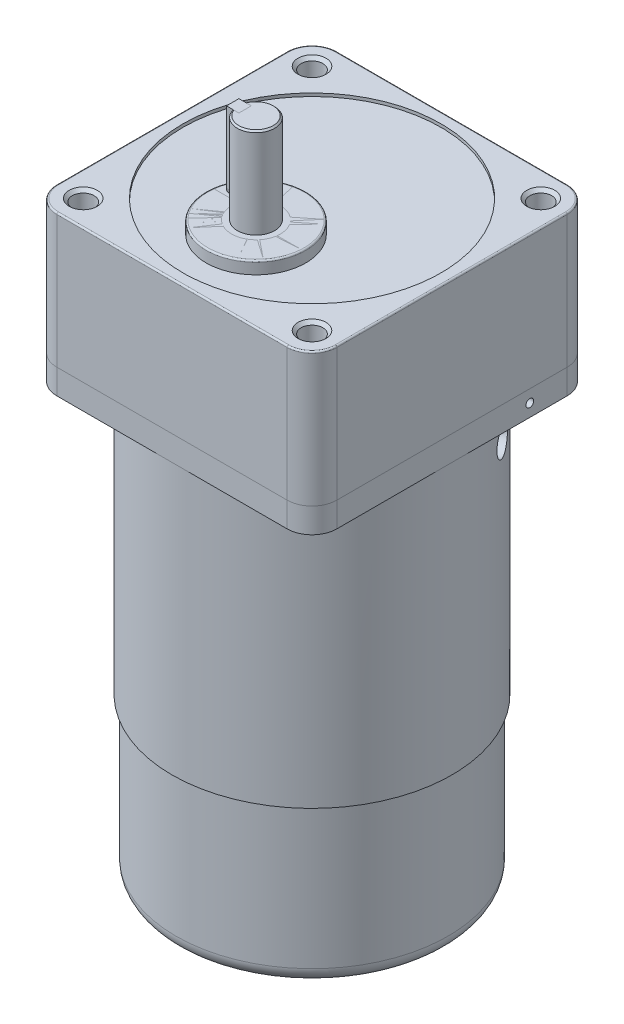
ISO-10303-21;
HEADER;
FILE_DESCRIPTION(('STEP AP214'),'2;1');
FILE_NAME('part.step','',(''),(''),'','','');
FILE_SCHEMA(('AUTOMOTIVE_DESIGN { 1 0 10303 214 1 1 1 1 }'));
ENDSEC;
DATA;
#1=APPLICATION_CONTEXT('core data for automotive mechanical design processes');
#2=APPLICATION_PROTOCOL_DEFINITION('international standard','automotive_design',2000,#1);
#3=PRODUCT_CONTEXT('',#1,'mechanical');
#4=PRODUCT('Part','Part','',(#3));
#5=PRODUCT_RELATED_PRODUCT_CATEGORY('part','',(#4));
#6=PRODUCT_DEFINITION_FORMATION('','',#4);
#7=PRODUCT_DEFINITION_CONTEXT('part definition',#1,'design');
#8=PRODUCT_DEFINITION('design','',#6,#7);
#9=PRODUCT_DEFINITION_SHAPE('','',#8);
#10=(LENGTH_UNIT() NAMED_UNIT(*) SI_UNIT(.MILLI.,.METRE.));
#11=(NAMED_UNIT(*) PLANE_ANGLE_UNIT() SI_UNIT($,.RADIAN.));
#12=(NAMED_UNIT(*) SI_UNIT($,.STERADIAN.) SOLID_ANGLE_UNIT());
#13=UNCERTAINTY_MEASURE_WITH_UNIT(LENGTH_MEASURE(1.E-05),#10,'distance_accuracy_value','');
#14=(GEOMETRIC_REPRESENTATION_CONTEXT(3) GLOBAL_UNCERTAINTY_ASSIGNED_CONTEXT((#13)) GLOBAL_UNIT_ASSIGNED_CONTEXT((#10,
#11,#12)) REPRESENTATION_CONTEXT('',''));
#15=CARTESIAN_POINT('',(0.,0.,0.));
#16=DIRECTION('',(0.,0.,1.));
#17=DIRECTION('',(1.,0.,0.));
#18=AXIS2_PLACEMENT_3D('',#15,#16,#17);
#19=CARTESIAN_POINT('',(1.9117,122.009885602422,18.0000000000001));
#20=DIRECTION('',(1.,0.,0.));
#21=DIRECTION('',(0.,0.,-1.));
#22=AXIS2_PLACEMENT_3D('',#19,#20,#21);
#23=CYLINDRICAL_SURFACE('',#22,2.);
#24=CARTESIAN_POINT('',(5.9117,122.009885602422,18.0000000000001));
#25=DIRECTION('',(-1.,0.,0.));
#26=DIRECTION('',(0.,0.,1.));
#27=AXIS2_PLACEMENT_3D('',#24,#25,#26);
#28=CIRCLE('',#27,2.);
#29=CARTESIAN_POINT('',(5.9117,122.009885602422,16.0000000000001));
#30=VERTEX_POINT('',#29);
#31=CARTESIAN_POINT('',(5.9117,122.009885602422,20.0000000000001));
#32=VERTEX_POINT('',#31);
#33=EDGE_CURVE('P0_E106',#30,#32,#28,.T.);
#34=ORIENTED_EDGE('',*,*,#33,.T.);
#35=DIRECTION('',(1.,0.,0.));
#36=VECTOR('',#35,1.);
#37=CARTESIAN_POINT('',(1.9117,122.009885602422,20.0000000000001));
#38=LINE('',#37,#36);
#39=CARTESIAN_POINT('',(1.9117,122.009885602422,20.0000000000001));
#40=VERTEX_POINT('',#39);
#41=EDGE_CURVE('P0_E12',#40,#32,#38,.T.);
#42=ORIENTED_EDGE('',*,*,#41,.F.);
#43=CARTESIAN_POINT('',(1.9117,122.009885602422,18.0000000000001));
#44=DIRECTION('',(-1.,0.,0.));
#45=DIRECTION('',(0.,0.,1.));
#46=AXIS2_PLACEMENT_3D('',#43,#44,#45);
#47=CIRCLE('',#46,2.);
#48=CARTESIAN_POINT('',(1.9117,122.009885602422,16.0000000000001));
#49=VERTEX_POINT('',#48);
#50=EDGE_CURVE('P0_E94',#49,#40,#47,.T.);
#51=ORIENTED_EDGE('',*,*,#50,.F.);
#52=DIRECTION('',(1.,0.,0.));
#53=VECTOR('',#52,1.);
#54=CARTESIAN_POINT('',(1.9117,122.009885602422,16.0000000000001));
#55=LINE('',#54,#53);
#56=EDGE_CURVE('P0_E102',#49,#30,#55,.T.);
#57=ORIENTED_EDGE('',*,*,#56,.T.);
#58=EDGE_LOOP('',(#34,#42,#51,#57));
#59=FACE_BOUND('',#58,.T.);
#60=ADVANCED_FACE('P0_F43',(#59),#23,.T.);
#61=CARTESIAN_POINT('',(1.9117,145.009885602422,20.0000000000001));
#62=DIRECTION('',(0.,0.,-1.));
#63=DIRECTION('',(-1.,0.,0.));
#64=AXIS2_PLACEMENT_3D('',#61,#62,#63);
#65=PLANE('',#64);
#66=DIRECTION('',(0.,1.,0.));
#67=VECTOR('',#66,1.);
#68=CARTESIAN_POINT('',(5.9117,145.009885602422,20.0000000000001));
#69=LINE('',#68,#67);
#70=CARTESIAN_POINT('',(5.9117,145.009885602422,20.0000000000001));
#71=VERTEX_POINT('',#70);
#72=EDGE_CURVE('P0_E98',#32,#71,#69,.T.);
#73=ORIENTED_EDGE('',*,*,#72,.T.);
#74=DIRECTION('',(1.,0.,0.));
#75=VECTOR('',#74,1.);
#76=CARTESIAN_POINT('',(1.9117,145.009885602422,20.0000000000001));
#77=LINE('',#76,#75);
#78=CARTESIAN_POINT('',(1.9117,145.009885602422,20.0000000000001));
#79=VERTEX_POINT('',#78);
#80=EDGE_CURVE('P0_E51',#79,#71,#77,.T.);
#81=ORIENTED_EDGE('',*,*,#80,.F.);
#82=DIRECTION('',(0.,1.,0.));
#83=VECTOR('',#82,1.);
#84=CARTESIAN_POINT('',(1.9117,145.009885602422,20.0000000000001));
#85=LINE('',#84,#83);
#86=EDGE_CURVE('P0_E89',#40,#79,#85,.T.);
#87=ORIENTED_EDGE('',*,*,#86,.F.);
#88=ORIENTED_EDGE('',*,*,#41,.T.);
#89=EDGE_LOOP('',(#73,#81,#87,#88));
#90=FACE_BOUND('',#89,.T.);
#91=ADVANCED_FACE('P0_F97',(#90),#65,.F.);
#92=CARTESIAN_POINT('',(1.9117,145.009885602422,16.0000000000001));
#93=DIRECTION('',(0.,-1.,0.));
#94=DIRECTION('',(0.,0.,-1.));
#95=AXIS2_PLACEMENT_3D('',#92,#93,#94);
#96=PLANE('',#95);
#97=DIRECTION('',(0.,0.,-1.));
#98=VECTOR('',#97,1.);
#99=CARTESIAN_POINT('',(5.9117,145.009885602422,16.0000000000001));
#100=LINE('',#99,#98);
#101=CARTESIAN_POINT('',(5.9117,145.009885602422,16.0000000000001));
#102=VERTEX_POINT('',#101);
#103=EDGE_CURVE('P0_E76',#71,#102,#100,.T.);
#104=ORIENTED_EDGE('',*,*,#103,.T.);
#105=DIRECTION('',(1.,0.,0.));
#106=VECTOR('',#105,1.);
#107=CARTESIAN_POINT('',(1.9117,145.009885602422,16.0000000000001));
#108=LINE('',#107,#106);
#109=CARTESIAN_POINT('',(1.9117,145.009885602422,16.0000000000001));
#110=VERTEX_POINT('',#109);
#111=EDGE_CURVE('P0_E99',#110,#102,#108,.T.);
#112=ORIENTED_EDGE('',*,*,#111,.F.);
#113=DIRECTION('',(0.,0.,-1.));
#114=VECTOR('',#113,1.);
#115=CARTESIAN_POINT('',(1.9117,145.009885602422,16.0000000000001));
#116=LINE('',#115,#114);
#117=EDGE_CURVE('P0_E92',#79,#110,#116,.T.);
#118=ORIENTED_EDGE('',*,*,#117,.F.);
#119=ORIENTED_EDGE('',*,*,#80,.T.);
#120=EDGE_LOOP('',(#104,#112,#118,#119));
#121=FACE_BOUND('',#120,.T.);
#122=ADVANCED_FACE('P0_F100',(#121),#96,.F.);
#123=CARTESIAN_POINT('',(1.9117,122.009885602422,16.0000000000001));
#124=DIRECTION('',(0.,0.,1.));
#125=DIRECTION('',(1.,0.,0.));
#126=AXIS2_PLACEMENT_3D('',#123,#124,#125);
#127=PLANE('',#126);
#128=DIRECTION('',(0.,-1.,0.));
#129=VECTOR('',#128,1.);
#130=CARTESIAN_POINT('',(5.9117,122.009885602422,16.0000000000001));
#131=LINE('',#130,#129);
#132=EDGE_CURVE('P0_E82',#102,#30,#131,.T.);
#133=ORIENTED_EDGE('',*,*,#132,.T.);
#134=ORIENTED_EDGE('',*,*,#56,.F.);
#135=DIRECTION('',(0.,-1.,0.));
#136=VECTOR('',#135,1.);
#137=CARTESIAN_POINT('',(1.9117,122.009885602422,16.0000000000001));
#138=LINE('',#137,#136);
#139=EDGE_CURVE('P0_E59',#110,#49,#138,.T.);
#140=ORIENTED_EDGE('',*,*,#139,.F.);
#141=ORIENTED_EDGE('',*,*,#111,.T.);
#142=EDGE_LOOP('',(#133,#134,#140,#141));
#143=FACE_BOUND('',#142,.T.);
#144=ADVANCED_FACE('P0_F113',(#143),#127,.F.);
#145=CARTESIAN_POINT('',(1.9117,122.009885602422,18.0000000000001));
#146=DIRECTION('',(-1.,0.,0.));
#147=DIRECTION('',(0.,0.,1.));
#148=AXIS2_PLACEMENT_3D('',#145,#146,#147);
#149=PLANE('',#148);
#150=ORIENTED_EDGE('',*,*,#50,.T.);
#151=ORIENTED_EDGE('',*,*,#86,.T.);
#152=ORIENTED_EDGE('',*,*,#117,.T.);
#153=ORIENTED_EDGE('',*,*,#139,.T.);
#154=EDGE_LOOP('',(#150,#151,#152,#153));
#155=FACE_BOUND('',#154,.T.);
#156=ADVANCED_FACE('P0_F90',(#155),#149,.T.);
#157=CARTESIAN_POINT('',(5.9117,122.009885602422,18.0000000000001));
#158=DIRECTION('',(-1.,0.,0.));
#159=DIRECTION('',(0.,0.,1.));
#160=AXIS2_PLACEMENT_3D('',#157,#158,#159);
#161=PLANE('',#160);
#162=ORIENTED_EDGE('',*,*,#33,.F.);
#163=ORIENTED_EDGE('',*,*,#132,.F.);
#164=ORIENTED_EDGE('',*,*,#103,.F.);
#165=ORIENTED_EDGE('',*,*,#72,.F.);
#166=EDGE_LOOP('',(#162,#163,#164,#165));
#167=FACE_BOUND('',#166,.T.);
#168=ADVANCED_FACE('P0_F116',(#167),#161,.F.);
#169=CLOSED_SHELL('',(#60,#91,#122,#144,#156,#168));
#170=MANIFOLD_SOLID_BREP('P0_B2',#169);
#171=CARTESIAN_POINT('',(9.41169727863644,145.009885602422,18.0000000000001));
#172=DIRECTION('',(0.,-1.,0.));
#173=DIRECTION('',(1.,0.,0.));
#174=AXIS2_PLACEMENT_3D('',#171,#172,#173);
#175=CYLINDRICAL_SURFACE('',#174,6.);
#176=CARTESIAN_POINT('',(9.41169727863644,116.009885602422,18.0000000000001));
#177=DIRECTION('',(0.,1.,0.));
#178=DIRECTION('',(-1.,0.,0.));
#179=AXIS2_PLACEMENT_3D('',#176,#177,#178);
#180=CIRCLE('',#179,6.);
#181=CARTESIAN_POINT('',(3.41169727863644,116.009885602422,18.0000000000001));
#182=VERTEX_POINT('',#181);
#183=EDGE_CURVE('P0_E247',#182,#182,#180,.T.);
#184=ORIENTED_EDGE('',*,*,#183,.T.);
#185=EDGE_LOOP('',(#184));
#186=FACE_BOUND('',#185,.T.);
#187=DIRECTION('',(0.,-1.,0.));
#188=VECTOR('',#187,1.);
#189=CARTESIAN_POINT('',(3.75484302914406,145.009885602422,16.0000000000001));
#190=LINE('',#189,#188);
#191=CARTESIAN_POINT('',(3.75484302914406,144.509885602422,16.0000000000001));
#192=VERTEX_POINT('',#191);
#193=CARTESIAN_POINT('',(3.75484302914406,122.009885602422,16.0000000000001));
#194=VERTEX_POINT('',#193);
#195=EDGE_CURVE('P0_E236',#192,#194,#190,.T.);
#196=ORIENTED_EDGE('',*,*,#195,.F.);
#197=CARTESIAN_POINT('',(9.41169727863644,144.509885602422,18.0000000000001));
#198=DIRECTION('',(0.,1.,0.));
#199=DIRECTION('',(0.,0.,1.));
#200=AXIS2_PLACEMENT_3D('',#197,#198,#199);
#201=CIRCLE('',#200,6.);
#202=CARTESIAN_POINT('',(3.75484302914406,144.509885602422,20.0000000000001));
#203=VERTEX_POINT('',#202);
#204=EDGE_CURVE('P0_E180',#192,#203,#201,.F.);
#205=ORIENTED_EDGE('',*,*,#204,.T.);
#206=DIRECTION('',(0.,-1.,0.));
#207=VECTOR('',#206,1.);
#208=CARTESIAN_POINT('',(3.75484302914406,145.009885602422,20.0000000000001));
#209=LINE('',#208,#207);
#210=CARTESIAN_POINT('',(3.75484302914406,122.009885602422,20.0000000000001));
#211=VERTEX_POINT('',#210);
#212=EDGE_CURVE('P0_E238',#211,#203,#209,.F.);
#213=ORIENTED_EDGE('',*,*,#212,.F.);
#214=CARTESIAN_POINT('',(3.75484302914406,122.009885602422,16.0000000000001));
#215=CARTESIAN_POINT('',(3.75484843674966,121.95530460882,15.9999985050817));
#216=CARTESIAN_POINT('',(3.75405207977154,121.900751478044,16.0022357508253));
#217=CARTESIAN_POINT('',(3.75091073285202,121.792068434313,16.0111487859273));
#218=CARTESIAN_POINT('',(3.748566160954,121.737938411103,16.0178233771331));
#219=CARTESIAN_POINT('',(3.73931543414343,121.577101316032,16.0443786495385));
#220=CARTESIAN_POINT('',(3.73019142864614,121.471523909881,16.0707915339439));
#221=CARTESIAN_POINT('',(3.70713578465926,121.266635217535,16.1400831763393));
#222=CARTESIAN_POINT('',(3.69320679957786,121.167320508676,16.182952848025));
#223=CARTESIAN_POINT('',(3.66212153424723,120.977205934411,16.2838535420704));
#224=CARTESIAN_POINT('',(3.64496327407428,120.886411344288,16.3418938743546));
#225=CARTESIAN_POINT('',(3.60860767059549,120.712445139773,16.4738972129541));
#226=CARTESIAN_POINT('',(3.58935972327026,120.629655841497,16.548350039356));
#227=CARTESIAN_POINT('',(3.55142030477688,120.477473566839,16.7100231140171));
#228=CARTESIAN_POINT('',(3.53272893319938,120.40808297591,16.797245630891));
#229=CARTESIAN_POINT('',(3.4974196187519,120.282926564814,16.9847927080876));
#230=CARTESIAN_POINT('',(3.48086852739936,120.227563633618,17.0853998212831));
#231=CARTESIAN_POINT('',(3.45230510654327,120.134701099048,17.2951415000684));
#232=CARTESIAN_POINT('',(3.44029139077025,120.097196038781,17.4042734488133));
#233=CARTESIAN_POINT('',(3.42251585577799,120.04241415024,17.623941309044));
#234=CARTESIAN_POINT('',(3.41655109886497,120.024479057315,17.7342963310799));
#235=CARTESIAN_POINT('',(3.4108251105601,120.007253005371,17.9566020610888));
#236=CARTESIAN_POINT('',(3.41106240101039,120.007957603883,18.0685523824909));
#237=CARTESIAN_POINT('',(3.41757650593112,120.027574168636,18.2862076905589));
#238=CARTESIAN_POINT('',(3.42361605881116,120.045770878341,18.3919854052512));
#239=CARTESIAN_POINT('',(3.44075806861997,120.098671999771,18.5988881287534));
#240=CARTESIAN_POINT('',(3.45186080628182,120.133377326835,18.700012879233));
#241=CARTESIAN_POINT('',(3.47818391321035,120.218728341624,18.896305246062));
#242=CARTESIAN_POINT('',(3.49345652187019,120.269577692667,18.9913770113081));
#243=CARTESIAN_POINT('',(3.52652952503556,120.385605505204,19.1718491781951));
#244=CARTESIAN_POINT('',(3.54433060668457,120.450787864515,19.2572469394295));
#245=CARTESIAN_POINT('',(3.58157183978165,120.597227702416,19.4201946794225));
#246=CARTESIAN_POINT('',(3.60104970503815,120.679096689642,19.4971872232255));
#247=CARTESIAN_POINT('',(3.63874746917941,120.854768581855,19.6365440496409));
#248=CARTESIAN_POINT('',(3.65696696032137,120.948575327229,19.6989036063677));
#249=CARTESIAN_POINT('',(3.69029665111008,121.147245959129,19.8080066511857));
#250=CARTESIAN_POINT('',(3.70535697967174,121.252252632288,19.8545060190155));
#251=CARTESIAN_POINT('',(3.73007533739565,121.469179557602,19.9289204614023));
#252=CARTESIAN_POINT('',(3.73974189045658,121.581088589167,19.9568648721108));
#253=CARTESIAN_POINT('',(3.74896643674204,121.746722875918,19.9833163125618));
#254=CARTESIAN_POINT('',(3.7511639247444,121.799168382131,19.9895701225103));
#255=CARTESIAN_POINT('',(3.75410320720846,121.904361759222,19.9979092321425));
#256=CARTESIAN_POINT('',(3.75484688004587,121.957109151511,19.9999999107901));
#257=CARTESIAN_POINT('',(3.75484302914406,122.009885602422,20.0000000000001));
#258=B_SPLINE_CURVE_WITH_KNOTS('',3,(#214,#215,#216,#217,#218,#219,#220,#221,#222,#223,#224,
#225,#226,#227,#228,#229,#230,#231,#232,#233,#234,#235,#236,#237,#238,#239,#240,#241,#242,#243,
#244,#245,#246,#247,#248,#249,#250,#251,#252,#253,#254,#255,#256,#257),.UNSPECIFIED.,.F.,.F.,(4,
2,2,2,2,2,2,2,2,2,2,2,2,2,2,2,2,2,2,2,2,4),(0.,0.163636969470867,0.327229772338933,
0.653162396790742,0.978915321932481,1.30486862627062,1.64233009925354,1.97985159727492,
2.32618265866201,2.67240782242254,3.00658941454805,3.34069136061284,3.6616883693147,
3.98270317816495,4.30794037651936,4.63326613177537,4.97388108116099,5.31460588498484,
5.66036059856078,6.00556734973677,6.16399790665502,6.32222363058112),.UNSPECIFIED.);
#259=EDGE_CURVE('P0_E259',#194,#211,#258,.T.);
#260=ORIENTED_EDGE('',*,*,#259,.F.);
#261=EDGE_LOOP('',(#196,#205,#213,#260));
#262=FACE_BOUND('',#261,.T.);
#263=ADVANCED_FACE('P0_F167',(#186,#262),#175,.T.);
#264=CARTESIAN_POINT('',(9.41169727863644,145.009885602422,18.0000000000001));
#265=DIRECTION('',(0.,1.,0.));
#266=DIRECTION('',(-1.,0.,0.));
#267=AXIS2_PLACEMENT_3D('',#264,#265,#266);
#268=PLANE('',#267);
#269=DIRECTION('',(-1.,0.,0.));
#270=VECTOR('',#269,1.);
#271=CARTESIAN_POINT('',(5.9117,145.009885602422,20.0000000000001));
#272=LINE('',#271,#270);
#273=CARTESIAN_POINT('',(5.9117,145.009885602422,20.0000000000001));
#274=VERTEX_POINT('',#273);
#275=CARTESIAN_POINT('',(4.28822189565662,145.009885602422,20.0000000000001));
#276=VERTEX_POINT('',#275);
#277=EDGE_CURVE('P0_E242',#274,#276,#272,.T.);
#278=ORIENTED_EDGE('',*,*,#277,.T.);
#279=CARTESIAN_POINT('',(9.41169727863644,145.009885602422,18.0000000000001));
#280=DIRECTION('',(0.,1.,0.));
#281=DIRECTION('',(-1.,0.,0.));
#282=AXIS2_PLACEMENT_3D('',#279,#280,#281);
#283=CIRCLE('',#282,5.50000000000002);
#284=CARTESIAN_POINT('',(4.28822189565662,145.009885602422,16.0000000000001));
#285=VERTEX_POINT('',#284);
#286=EDGE_CURVE('P0_E266',#276,#285,#283,.T.);
#287=ORIENTED_EDGE('',*,*,#286,.T.);
#288=DIRECTION('',(-1.,0.,0.));
#289=VECTOR('',#288,1.);
#290=CARTESIAN_POINT('',(5.9117,145.009885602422,16.0000000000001));
#291=LINE('',#290,#289);
#292=CARTESIAN_POINT('',(5.9117,145.009885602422,16.0000000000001));
#293=VERTEX_POINT('',#292);
#294=EDGE_CURVE('P0_E239',#293,#285,#291,.T.);
#295=ORIENTED_EDGE('',*,*,#294,.F.);
#296=DIRECTION('',(0.,0.,1.));
#297=VECTOR('',#296,1.);
#298=CARTESIAN_POINT('',(5.9117,145.009885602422,16.0000000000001));
#299=LINE('',#298,#297);
#300=EDGE_CURVE('P0_E223',#293,#274,#299,.T.);
#301=ORIENTED_EDGE('',*,*,#300,.T.);
#302=EDGE_LOOP('',(#278,#287,#295,#301));
#303=FACE_BOUND('',#302,.T.);
#304=ADVANCED_FACE('P0_F276',(#303),#268,.T.);
#305=CARTESIAN_POINT('',(9.41169727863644,116.009885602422,18.0000000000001));
#306=DIRECTION('',(0.,1.,0.));
#307=DIRECTION('',(-1.,0.,0.));
#308=AXIS2_PLACEMENT_3D('',#305,#306,#307);
#309=PLANE('',#308);
#310=CARTESIAN_POINT('',(9.41169727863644,116.009885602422,18.0000000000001));
#311=DIRECTION('',(0.,1.,0.));
#312=DIRECTION('',(-1.,0.,0.));
#313=AXIS2_PLACEMENT_3D('',#310,#311,#312);
#314=CIRCLE('',#313,15.5);
#315=CARTESIAN_POINT('',(-6.08830272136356,116.009885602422,18.0000000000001));
#316=VERTEX_POINT('',#315);
#317=EDGE_CURVE('P0_E253',#316,#316,#314,.T.);
#318=ORIENTED_EDGE('',*,*,#317,.T.);
#319=EDGE_LOOP('',(#318));
#320=FACE_BOUND('',#319,.T.);
#321=ORIENTED_EDGE('',*,*,#183,.F.);
#322=EDGE_LOOP('',(#321));
#323=FACE_BOUND('',#322,.T.);
#324=ADVANCED_FACE('P0_F278',(#320,#323),#309,.T.);
#325=CARTESIAN_POINT('',(9.41169727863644,116.009885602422,18.0000000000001));
#326=DIRECTION('',(0.,-1.,0.));
#327=DIRECTION('',(1.,0.,0.));
#328=AXIS2_PLACEMENT_3D('',#325,#326,#327);
#329=CYLINDRICAL_SURFACE('',#328,16.);
#330=CARTESIAN_POINT('',(9.41169727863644,115.509885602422,18.0000000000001));
#331=DIRECTION('',(0.,1.,0.));
#332=DIRECTION('',(-1.,0.,0.));
#333=AXIS2_PLACEMENT_3D('',#330,#331,#332);
#334=CIRCLE('',#333,16.);
#335=CARTESIAN_POINT('',(-6.58830272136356,115.509885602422,18.0000000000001));
#336=VERTEX_POINT('',#335);
#337=EDGE_CURVE('P0_E256',#336,#336,#334,.F.);
#338=ORIENTED_EDGE('',*,*,#337,.T.);
#339=EDGE_LOOP('',(#338));
#340=FACE_BOUND('',#339,.T.);
#341=CARTESIAN_POINT('',(9.41169727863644,112.009885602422,18.0000000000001));
#342=DIRECTION('',(0.,1.,0.));
#343=DIRECTION('',(-1.,0.,0.));
#344=AXIS2_PLACEMENT_3D('',#341,#342,#343);
#345=CIRCLE('',#344,16.);
#346=CARTESIAN_POINT('',(-6.58830272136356,112.009885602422,18.0000000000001));
#347=VERTEX_POINT('',#346);
#348=EDGE_CURVE('P0_E250',#347,#347,#345,.T.);
#349=ORIENTED_EDGE('',*,*,#348,.T.);
#350=EDGE_LOOP('',(#349));
#351=FACE_BOUND('',#350,.T.);
#352=ADVANCED_FACE('P0_F284',(#340,#351),#329,.T.);
#353=CARTESIAN_POINT('',(9.41169727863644,112.009885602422,18.0000000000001));
#354=DIRECTION('',(0.,1.,0.));
#355=DIRECTION('',(-1.,0.,0.));
#356=AXIS2_PLACEMENT_3D('',#353,#354,#355);
#357=PLANE('',#356);
#358=ORIENTED_EDGE('',*,*,#348,.F.);
#359=EDGE_LOOP('',(#358));
#360=FACE_BOUND('',#359,.T.);
#361=ADVANCED_FACE('P0_F323',(#360),#357,.F.);
#362=CARTESIAN_POINT('',(9.41169727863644,115.509885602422,18.0000000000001));
#363=DIRECTION('',(0.,1.,0.));
#364=DIRECTION('',(-1.,0.,0.));
#365=AXIS2_PLACEMENT_3D('',#362,#363,#364);
#366=TOROIDAL_SURFACE('',#365,15.5,0.5);
#367=ORIENTED_EDGE('',*,*,#337,.F.);
#368=EDGE_LOOP('',(#367));
#369=FACE_BOUND('',#368,.T.);
#370=ORIENTED_EDGE('',*,*,#317,.F.);
#371=EDGE_LOOP('',(#370));
#372=FACE_BOUND('',#371,.T.);
#373=ADVANCED_FACE('P0_F274',(#369,#372),#366,.T.);
#374=CARTESIAN_POINT('',(5.9117,122.009885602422,18.0000000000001));
#375=DIRECTION('',(-1.,0.,0.));
#376=DIRECTION('',(0.,0.,1.));
#377=AXIS2_PLACEMENT_3D('',#374,#375,#376);
#378=CYLINDRICAL_SURFACE('',#377,2.);
#379=DIRECTION('',(-1.,0.,0.));
#380=VECTOR('',#379,1.);
#381=CARTESIAN_POINT('',(5.9117,122.009885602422,16.0000000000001));
#382=LINE('',#381,#380);
#383=CARTESIAN_POINT('',(5.9117,122.009885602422,16.0000000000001));
#384=VERTEX_POINT('',#383);
#385=EDGE_CURVE('P0_E231',#384,#194,#382,.T.);
#386=ORIENTED_EDGE('',*,*,#385,.T.);
#387=ORIENTED_EDGE('',*,*,#259,.T.);
#388=DIRECTION('',(-1.,0.,0.));
#389=VECTOR('',#388,1.);
#390=CARTESIAN_POINT('',(5.9117,122.009885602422,20.0000000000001));
#391=LINE('',#390,#389);
#392=CARTESIAN_POINT('',(5.9117,122.009885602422,20.0000000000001));
#393=VERTEX_POINT('',#392);
#394=EDGE_CURVE('P0_E233',#393,#211,#391,.T.);
#395=ORIENTED_EDGE('',*,*,#394,.F.);
#396=CARTESIAN_POINT('',(5.9117,122.009885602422,18.0000000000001));
#397=DIRECTION('',(1.,0.,0.));
#398=DIRECTION('',(0.,0.,-1.));
#399=AXIS2_PLACEMENT_3D('',#396,#397,#398);
#400=CIRCLE('',#399,2.);
#401=EDGE_CURVE('P0_E221',#393,#384,#400,.T.);
#402=ORIENTED_EDGE('',*,*,#401,.T.);
#403=EDGE_LOOP('',(#386,#387,#395,#402));
#404=FACE_BOUND('',#403,.T.);
#405=ADVANCED_FACE('P0_F230',(#404),#378,.F.);
#406=CARTESIAN_POINT('',(5.9117,122.009885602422,16.0000000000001));
#407=DIRECTION('',(0.,0.,1.));
#408=DIRECTION('',(1.,0.,0.));
#409=AXIS2_PLACEMENT_3D('',#406,#407,#408);
#410=PLANE('',#409);
#411=ORIENTED_EDGE('',*,*,#294,.T.);
#412=CARTESIAN_POINT('',(4.28822189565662,145.009885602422,16.0000000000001));
#413=CARTESIAN_POINT('',(4.1990759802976,144.926818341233,16.0000000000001));
#414=CARTESIAN_POINT('',(4.11005477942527,144.843618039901,16.0000000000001));
#415=CARTESIAN_POINT('',(3.93226182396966,144.676951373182,16.0000000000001));
#416=CARTESIAN_POINT('',(3.84349006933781,144.593485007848,16.0000000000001));
#417=CARTESIAN_POINT('',(3.75484302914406,144.509885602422,16.0000000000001));
#418=B_SPLINE_CURVE_WITH_KNOTS('',3,(#412,#413,#414,#415,#416,#417),.UNSPECIFIED.,.F.,.F.,(4,2,
4),(0.,0.36554559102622,0.731091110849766),.UNSPECIFIED.);
#419=EDGE_CURVE('P0_E194',#285,#192,#418,.T.);
#420=ORIENTED_EDGE('',*,*,#419,.T.);
#421=ORIENTED_EDGE('',*,*,#195,.T.);
#422=ORIENTED_EDGE('',*,*,#385,.F.);
#423=DIRECTION('',(0.,1.,0.));
#424=VECTOR('',#423,1.);
#425=CARTESIAN_POINT('',(5.9117,122.009885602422,16.0000000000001));
#426=LINE('',#425,#424);
#427=EDGE_CURVE('P0_E218',#384,#293,#426,.T.);
#428=ORIENTED_EDGE('',*,*,#427,.T.);
#429=EDGE_LOOP('',(#411,#420,#421,#422,#428));
#430=FACE_BOUND('',#429,.T.);
#431=ADVANCED_FACE('P0_F235',(#430),#410,.T.);
#432=CARTESIAN_POINT('',(5.9117,145.009885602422,20.0000000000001));
#433=DIRECTION('',(0.,0.,-1.));
#434=DIRECTION('',(-1.,0.,0.));
#435=AXIS2_PLACEMENT_3D('',#432,#433,#434);
#436=PLANE('',#435);
#437=ORIENTED_EDGE('',*,*,#212,.T.);
#438=CARTESIAN_POINT('',(3.75484302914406,144.509885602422,20.0000000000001));
#439=CARTESIAN_POINT('',(3.8434900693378,144.593485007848,20.0000000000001));
#440=CARTESIAN_POINT('',(3.93226182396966,144.676951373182,20.0000000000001));
#441=CARTESIAN_POINT('',(4.11005477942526,144.843618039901,20.0000000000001));
#442=CARTESIAN_POINT('',(4.19907598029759,144.926818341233,20.0000000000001));
#443=CARTESIAN_POINT('',(4.28822189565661,145.009885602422,20.0000000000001));
#444=B_SPLINE_CURVE_WITH_KNOTS('',3,(#438,#439,#440,#441,#442,#443),.UNSPECIFIED.,.F.,.F.,(4,2,
4),(0.,0.365545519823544,0.731091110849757),.UNSPECIFIED.);
#445=EDGE_CURVE('P0_E41',#203,#276,#444,.T.);
#446=ORIENTED_EDGE('',*,*,#445,.T.);
#447=ORIENTED_EDGE('',*,*,#277,.F.);
#448=DIRECTION('',(0.,-1.,0.));
#449=VECTOR('',#448,1.);
#450=CARTESIAN_POINT('',(5.9117,145.009885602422,20.0000000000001));
#451=LINE('',#450,#449);
#452=EDGE_CURVE('P0_E298',#274,#393,#451,.T.);
#453=ORIENTED_EDGE('',*,*,#452,.T.);
#454=ORIENTED_EDGE('',*,*,#394,.T.);
#455=EDGE_LOOP('',(#437,#446,#447,#453,#454));
#456=FACE_BOUND('',#455,.T.);
#457=ADVANCED_FACE('P0_F297',(#456),#436,.T.);
#458=CARTESIAN_POINT('',(5.9117,122.009885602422,18.0000000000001));
#459=DIRECTION('',(1.,0.,0.));
#460=DIRECTION('',(0.,0.,-1.));
#461=AXIS2_PLACEMENT_3D('',#458,#459,#460);
#462=PLANE('',#461);
#463=ORIENTED_EDGE('',*,*,#401,.F.);
#464=ORIENTED_EDGE('',*,*,#452,.F.);
#465=ORIENTED_EDGE('',*,*,#300,.F.);
#466=ORIENTED_EDGE('',*,*,#427,.F.);
#467=EDGE_LOOP('',(#463,#464,#465,#466));
#468=FACE_BOUND('',#467,.T.);
#469=ADVANCED_FACE('P0_F220',(#468),#462,.F.);
#470=CARTESIAN_POINT('',(9.41169727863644,145.009885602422,18.0000000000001));
#471=DIRECTION('',(0.,-1.,0.));
#472=DIRECTION('',(0.,0.,-1.));
#473=AXIS2_PLACEMENT_3D('',#470,#471,#472);
#474=CONICAL_SURFACE('',#473,5.50000000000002,0.78539816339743);
#475=ORIENTED_EDGE('',*,*,#445,.F.);
#476=ORIENTED_EDGE('',*,*,#204,.F.);
#477=ORIENTED_EDGE('',*,*,#419,.F.);
#478=ORIENTED_EDGE('',*,*,#286,.F.);
#479=EDGE_LOOP('',(#475,#476,#477,#478));
#480=FACE_BOUND('',#479,.T.);
#481=ADVANCED_FACE('P0_F169',(#480),#474,.T.);
#482=CLOSED_SHELL('',(#263,#304,#324,#352,#361,#373,#405,#431,#457,#469,#481));
#483=MANIFOLD_SOLID_BREP('P0_B6',#482);
#484=CARTESIAN_POINT('',(9.4116972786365,109.009885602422,1.2490009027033E-13));
#485=DIRECTION('',(0.,-1.,0.));
#486=DIRECTION('',(1.,0.,0.));
#487=AXIS2_PLACEMENT_3D('',#484,#485,#486);
#488=CYLINDRICAL_SURFACE('',#487,42.4);
#489=DIRECTION('',(0.,-1.,0.));
#490=VECTOR('',#489,1.);
#491=CARTESIAN_POINT('',(-18.8350191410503,109.009885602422,31.6209267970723));
#492=LINE('',#491,#490);
#493=CARTESIAN_POINT('',(-18.8350191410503,108.009885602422,31.6209267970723));
#494=VERTEX_POINT('',#493);
#495=CARTESIAN_POINT('',(-18.8350191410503,79.0098856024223,31.6209267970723));
#496=VERTEX_POINT('',#495);
#497=EDGE_CURVE('P1_E25',#494,#496,#492,.T.);
#498=ORIENTED_EDGE('',*,*,#497,.F.);
#499=CARTESIAN_POINT('',(9.4116972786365,108.009885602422,1.2490009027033E-13));
#500=DIRECTION('',(0.,-1.,0.));
#501=DIRECTION('',(1.,0.,0.));
#502=AXIS2_PLACEMENT_3D('',#499,#500,#501);
#503=CIRCLE('',#502,42.4);
#504=CARTESIAN_POINT('',(7.41169727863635,108.009885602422,42.3528039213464));
#505=VERTEX_POINT('',#504);
#506=EDGE_CURVE('P1_E48',#494,#505,#503,.F.);
#507=ORIENTED_EDGE('',*,*,#506,.T.);
#508=DIRECTION('',(0.,1.,0.));
#509=VECTOR('',#508,1.);
#510=CARTESIAN_POINT('',(7.41169727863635,103.009885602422,42.3528039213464));
#511=LINE('',#510,#509);
#512=CARTESIAN_POINT('',(7.41169727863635,103.009885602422,42.3528039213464));
#513=VERTEX_POINT('',#512);
#514=EDGE_CURVE('P1_E53',#513,#505,#511,.T.);
#515=ORIENTED_EDGE('',*,*,#514,.F.);
#516=CARTESIAN_POINT('',(9.4116972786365,103.009885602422,1.2490009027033E-13));
#517=DIRECTION('',(0.,-1.,0.));
#518=DIRECTION('',(1.,0.,0.));
#519=AXIS2_PLACEMENT_3D('',#516,#517,#518);
#520=CIRCLE('',#519,42.4);
#521=CARTESIAN_POINT('',(11.4116972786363,103.009885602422,42.3528039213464));
#522=VERTEX_POINT('',#521);
#523=EDGE_CURVE('P1_E59',#522,#513,#520,.T.);
#524=ORIENTED_EDGE('',*,*,#523,.F.);
#525=DIRECTION('',(0.,1.,0.));
#526=VECTOR('',#525,1.);
#527=CARTESIAN_POINT('',(11.4116972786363,103.009885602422,42.3528039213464));
#528=LINE('',#527,#526);
#529=CARTESIAN_POINT('',(11.4116972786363,108.009885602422,42.3528039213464));
#530=VERTEX_POINT('',#529);
#531=EDGE_CURVE('P1_E65',#522,#530,#528,.T.);
#532=ORIENTED_EDGE('',*,*,#531,.T.);
#533=CARTESIAN_POINT('',(9.4116972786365,108.009885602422,1.2490009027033E-13));
#534=DIRECTION('',(0.,-1.,0.));
#535=DIRECTION('',(1.,0.,0.));
#536=AXIS2_PLACEMENT_3D('',#533,#534,#535);
#537=CIRCLE('',#536,42.4);
#538=CARTESIAN_POINT('',(37.2242835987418,108.009885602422,32.0034379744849));
#539=VERTEX_POINT('',#538);
#540=EDGE_CURVE('P1_E68',#530,#539,#537,.F.);
#541=ORIENTED_EDGE('',*,*,#540,.T.);
#542=DIRECTION('',(0.,-1.,0.));
#543=VECTOR('',#542,1.);
#544=CARTESIAN_POINT('',(37.2242835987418,109.009885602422,32.0034379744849));
#545=LINE('',#544,#543);
#546=CARTESIAN_POINT('',(37.2242835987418,79.0098856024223,32.0034379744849));
#547=VERTEX_POINT('',#546);
#548=EDGE_CURVE('P1_E21',#539,#547,#545,.T.);
#549=ORIENTED_EDGE('',*,*,#548,.T.);
#550=CARTESIAN_POINT('',(9.4116972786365,79.0098856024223,1.2490009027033E-13));
#551=DIRECTION('',(0.,-1.,0.));
#552=DIRECTION('',(1.,0.,0.));
#553=AXIS2_PLACEMENT_3D('',#550,#551,#552);
#554=CIRCLE('',#553,42.4);
#555=EDGE_CURVE('P1_E11',#547,#496,#554,.T.);
#556=ORIENTED_EDGE('',*,*,#555,.T.);
#557=EDGE_LOOP('',(#498,#507,#515,#524,#532,#541,#549,#556));
#558=FACE_BOUND('',#557,.T.);
#559=ADVANCED_FACE('P1_F16',(#558),#488,.F.);
#560=OPEN_SHELL('',(#559));
#561=SHELL_BASED_SURFACE_MODEL('P1_B1',(#560));
#562=CARTESIAN_POINT('',(9.41169727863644,109.009885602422,18.0000000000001));
#563=DIRECTION('',(0.,-1.,0.));
#564=DIRECTION('',(1.,0.,0.));
#565=AXIS2_PLACEMENT_3D('',#562,#563,#564);
#566=CYLINDRICAL_SURFACE('',#565,16.);
#567=CARTESIAN_POINT('',(9.41169727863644,101.209885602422,18.0000000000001));
#568=DIRECTION('',(0.,-1.,0.));
#569=DIRECTION('',(1.,0.,0.));
#570=AXIS2_PLACEMENT_3D('',#567,#568,#569);
#571=CIRCLE('',#570,16.);
#572=CARTESIAN_POINT('',(25.4116972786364,101.209885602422,18.0000000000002));
#573=VERTEX_POINT('',#572);
#574=EDGE_CURVE('P2_E18',#573,#573,#571,.T.);
#575=ORIENTED_EDGE('',*,*,#574,.T.);
#576=EDGE_LOOP('',(#575));
#577=FACE_BOUND('',#576,.T.);
#578=CARTESIAN_POINT('',(9.41169727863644,109.009885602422,18.0000000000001));
#579=DIRECTION('',(0.,-1.,0.));
#580=DIRECTION('',(1.,0.,0.));
#581=AXIS2_PLACEMENT_3D('',#578,#579,#580);
#582=CIRCLE('',#581,16.);
#583=CARTESIAN_POINT('',(25.4116972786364,109.009885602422,18.0000000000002));
#584=VERTEX_POINT('',#583);
#585=EDGE_CURVE('P2_E10',#584,#584,#582,.T.);
#586=ORIENTED_EDGE('',*,*,#585,.F.);
#587=EDGE_LOOP('',(#586));
#588=FACE_BOUND('',#587,.T.);
#589=ADVANCED_FACE('P2_F14',(#577,#588),#566,.F.);
#590=OPEN_SHELL('',(#589));
#591=SHELL_BASED_SURFACE_MODEL('P2_B1',(#590));
#592=CARTESIAN_POINT('',(46.1812499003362,116.009885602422,36.7695526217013));
#593=DIRECTION('',(0.,-1.,0.));
#594=DIRECTION('',(1.,0.,0.));
#595=AXIS2_PLACEMENT_3D('',#592,#593,#594);
#596=CYLINDRICAL_SURFACE('',#595,3.5);
#597=CARTESIAN_POINT('',(46.1812499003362,112.009885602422,36.7695526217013));
#598=DIRECTION('',(0.,-1.,0.));
#599=DIRECTION('',(1.,0.,0.));
#600=AXIS2_PLACEMENT_3D('',#597,#598,#599);
#601=CIRCLE('',#600,3.5);
#602=CARTESIAN_POINT('',(49.6812499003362,112.009885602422,36.7695526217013));
#603=VERTEX_POINT('',#602);
#604=EDGE_CURVE('P3_E22',#603,#603,#601,.F.);
#605=ORIENTED_EDGE('',*,*,#604,.T.);
#606=EDGE_LOOP('',(#605));
#607=FACE_BOUND('',#606,.T.);
#608=CARTESIAN_POINT('',(46.1812499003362,71.0098856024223,36.7695526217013));
#609=DIRECTION('',(0.,-1.,0.));
#610=DIRECTION('',(1.,0.,0.));
#611=AXIS2_PLACEMENT_3D('',#608,#609,#610);
#612=CIRCLE('',#611,3.5);
#613=CARTESIAN_POINT('',(49.6812499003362,71.0098856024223,36.7695526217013));
#614=VERTEX_POINT('',#613);
#615=EDGE_CURVE('P3_E11',#614,#614,#612,.T.);
#616=ORIENTED_EDGE('',*,*,#615,.T.);
#617=EDGE_LOOP('',(#616));
#618=FACE_BOUND('',#617,.T.);
#619=ADVANCED_FACE('P3_F16',(#607,#618),#596,.F.);
#620=CARTESIAN_POINT('',(46.1812499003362,113.009885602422,36.7695526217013));
#621=DIRECTION('',(0.,1.,0.));
#622=DIRECTION('',(-1.,0.,0.));
#623=AXIS2_PLACEMENT_3D('',#620,#621,#622);
#624=CONICAL_SURFACE('',#623,4.49999999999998,0.785398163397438);
#625=ORIENTED_EDGE('',*,*,#604,.F.);
#626=EDGE_LOOP('',(#625));
#627=FACE_BOUND('',#626,.T.);
#628=CARTESIAN_POINT('',(46.1812499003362,113.009885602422,36.7695526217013));
#629=DIRECTION('',(0.,-1.,0.));
#630=DIRECTION('',(1.,0.,0.));
#631=AXIS2_PLACEMENT_3D('',#628,#629,#630);
#632=CIRCLE('',#631,4.49999999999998);
#633=CARTESIAN_POINT('',(50.6812499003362,113.009885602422,36.7695526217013));
#634=VERTEX_POINT('',#633);
#635=EDGE_CURVE('P3_E251',#634,#634,#632,.T.);
#636=ORIENTED_EDGE('',*,*,#635,.F.);
#637=EDGE_LOOP('',(#636));
#638=FACE_BOUND('',#637,.T.);
#639=ADVANCED_FACE('P3_F245',(#627,#638),#624,.F.);
#640=CARTESIAN_POINT('',(46.1812499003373,116.009885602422,-36.7695526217));
#641=DIRECTION('',(0.,-1.,0.));
#642=DIRECTION('',(1.,0.,0.));
#643=AXIS2_PLACEMENT_3D('',#640,#641,#642);
#644=CYLINDRICAL_SURFACE('',#643,3.5);
#645=CARTESIAN_POINT('',(46.1812499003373,112.009885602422,-36.7695526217));
#646=DIRECTION('',(0.,-1.,0.));
#647=DIRECTION('',(1.,0.,0.));
#648=AXIS2_PLACEMENT_3D('',#645,#646,#647);
#649=CIRCLE('',#648,3.5);
#650=CARTESIAN_POINT('',(49.6812499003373,112.009885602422,-36.7695526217));
#651=VERTEX_POINT('',#650);
#652=EDGE_CURVE('P3_E234',#651,#651,#649,.F.);
#653=ORIENTED_EDGE('',*,*,#652,.T.);
#654=EDGE_LOOP('',(#653));
#655=FACE_BOUND('',#654,.T.);
#656=CARTESIAN_POINT('',(46.1812499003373,71.0098856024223,-36.7695526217));
#657=DIRECTION('',(0.,-1.,0.));
#658=DIRECTION('',(1.,0.,0.));
#659=AXIS2_PLACEMENT_3D('',#656,#657,#658);
#660=CIRCLE('',#659,3.5);
#661=CARTESIAN_POINT('',(49.6812499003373,71.0098856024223,-36.7695526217));
#662=VERTEX_POINT('',#661);
#663=EDGE_CURVE('P3_E237',#662,#662,#660,.T.);
#664=ORIENTED_EDGE('',*,*,#663,.T.);
#665=EDGE_LOOP('',(#664));
#666=FACE_BOUND('',#665,.T.);
#667=ADVANCED_FACE('P3_F248',(#655,#666),#644,.F.);
#668=CARTESIAN_POINT('',(46.1812499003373,113.009885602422,-36.7695526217));
#669=DIRECTION('',(0.,1.,0.));
#670=DIRECTION('',(-1.,0.,0.));
#671=AXIS2_PLACEMENT_3D('',#668,#669,#670);
#672=CONICAL_SURFACE('',#671,4.49999999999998,0.785398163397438);
#673=ORIENTED_EDGE('',*,*,#652,.F.);
#674=EDGE_LOOP('',(#673));
#675=FACE_BOUND('',#674,.T.);
#676=CARTESIAN_POINT('',(46.1812499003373,113.009885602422,-36.7695526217));
#677=DIRECTION('',(0.,-1.,0.));
#678=DIRECTION('',(1.,0.,0.));
#679=AXIS2_PLACEMENT_3D('',#676,#677,#678);
#680=CIRCLE('',#679,4.49999999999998);
#681=CARTESIAN_POINT('',(50.6812499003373,113.009885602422,-36.7695526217));
#682=VERTEX_POINT('',#681);
#683=EDGE_CURVE('P3_E253',#682,#682,#680,.T.);
#684=ORIENTED_EDGE('',*,*,#683,.F.);
#685=EDGE_LOOP('',(#684));
#686=FACE_BOUND('',#685,.T.);
#687=ADVANCED_FACE('P3_F394',(#675,#686),#672,.F.);
#688=CARTESIAN_POINT('',(-27.3578553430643,116.009885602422,36.7695526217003));
#689=DIRECTION('',(0.,-1.,0.));
#690=DIRECTION('',(1.,0.,0.));
#691=AXIS2_PLACEMENT_3D('',#688,#689,#690);
#692=CYLINDRICAL_SURFACE('',#691,3.5);
#693=CARTESIAN_POINT('',(-27.3578553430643,112.009885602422,36.7695526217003));
#694=DIRECTION('',(0.,-1.,0.));
#695=DIRECTION('',(1.,0.,0.));
#696=AXIS2_PLACEMENT_3D('',#693,#694,#695);
#697=CIRCLE('',#696,3.5);
#698=CARTESIAN_POINT('',(-23.8578553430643,112.009885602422,36.7695526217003));
#699=VERTEX_POINT('',#698);
#700=EDGE_CURVE('P3_E227',#699,#699,#697,.F.);
#701=ORIENTED_EDGE('',*,*,#700,.T.);
#702=EDGE_LOOP('',(#701));
#703=FACE_BOUND('',#702,.T.);
#704=CARTESIAN_POINT('',(-27.3578553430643,71.0098856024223,36.7695526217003));
#705=DIRECTION('',(0.,-1.,0.));
#706=DIRECTION('',(1.,0.,0.));
#707=AXIS2_PLACEMENT_3D('',#704,#705,#706);
#708=CIRCLE('',#707,3.5);
#709=CARTESIAN_POINT('',(-23.8578553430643,71.0098856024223,36.7695526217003));
#710=VERTEX_POINT('',#709);
#711=EDGE_CURVE('P3_E230',#710,#710,#708,.T.);
#712=ORIENTED_EDGE('',*,*,#711,.T.);
#713=EDGE_LOOP('',(#712));
#714=FACE_BOUND('',#713,.T.);
#715=ADVANCED_FACE('P3_F390',(#703,#714),#692,.F.);
#716=CARTESIAN_POINT('',(-27.3578553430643,113.009885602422,36.7695526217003));
#717=DIRECTION('',(0.,1.,0.));
#718=DIRECTION('',(-1.,0.,0.));
#719=AXIS2_PLACEMENT_3D('',#716,#717,#718);
#720=CONICAL_SURFACE('',#719,4.49999999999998,0.785398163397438);
#721=ORIENTED_EDGE('',*,*,#700,.F.);
#722=EDGE_LOOP('',(#721));
#723=FACE_BOUND('',#722,.T.);
#724=CARTESIAN_POINT('',(-27.3578553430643,113.009885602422,36.7695526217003));
#725=DIRECTION('',(0.,-1.,0.));
#726=DIRECTION('',(1.,0.,0.));
#727=AXIS2_PLACEMENT_3D('',#724,#725,#726);
#728=CIRCLE('',#727,4.49999999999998);
#729=CARTESIAN_POINT('',(-22.8578553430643,113.009885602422,36.7695526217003));
#730=VERTEX_POINT('',#729);
#731=EDGE_CURVE('P3_E256',#730,#730,#728,.T.);
#732=ORIENTED_EDGE('',*,*,#731,.F.);
#733=EDGE_LOOP('',(#732));
#734=FACE_BOUND('',#733,.T.);
#735=ADVANCED_FACE('P3_F386',(#723,#734),#720,.F.);
#736=CARTESIAN_POINT('',(-27.3578553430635,116.009885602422,-36.7695526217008));
#737=DIRECTION('',(0.,-1.,0.));
#738=DIRECTION('',(1.,0.,0.));
#739=AXIS2_PLACEMENT_3D('',#736,#737,#738);
#740=CYLINDRICAL_SURFACE('',#739,3.5);
#741=CARTESIAN_POINT('',(-27.3578553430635,112.009885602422,-36.7695526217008));
#742=DIRECTION('',(0.,-1.,0.));
#743=DIRECTION('',(1.,0.,0.));
#744=AXIS2_PLACEMENT_3D('',#741,#742,#743);
#745=CIRCLE('',#744,3.5);
#746=CARTESIAN_POINT('',(-23.8578553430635,112.009885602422,-36.7695526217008));
#747=VERTEX_POINT('',#746);
#748=EDGE_CURVE('P3_E220',#747,#747,#745,.F.);
#749=ORIENTED_EDGE('',*,*,#748,.T.);
#750=EDGE_LOOP('',(#749));
#751=FACE_BOUND('',#750,.T.);
#752=CARTESIAN_POINT('',(-27.3578553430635,71.0098856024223,-36.7695526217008));
#753=DIRECTION('',(0.,-1.,0.));
#754=DIRECTION('',(1.,0.,0.));
#755=AXIS2_PLACEMENT_3D('',#752,#753,#754);
#756=CIRCLE('',#755,3.5);
#757=CARTESIAN_POINT('',(-23.8578553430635,71.0098856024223,-36.7695526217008));
#758=VERTEX_POINT('',#757);
#759=EDGE_CURVE('P3_E223',#758,#758,#756,.T.);
#760=ORIENTED_EDGE('',*,*,#759,.T.);
#761=EDGE_LOOP('',(#760));
#762=FACE_BOUND('',#761,.T.);
#763=ADVANCED_FACE('P3_F382',(#751,#762),#740,.F.);
#764=CARTESIAN_POINT('',(-27.3578553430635,113.009885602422,-36.7695526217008));
#765=DIRECTION('',(0.,1.,0.));
#766=DIRECTION('',(-1.,0.,0.));
#767=AXIS2_PLACEMENT_3D('',#764,#765,#766);
#768=CONICAL_SURFACE('',#767,4.49999999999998,0.785398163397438);
#769=ORIENTED_EDGE('',*,*,#748,.F.);
#770=EDGE_LOOP('',(#769));
#771=FACE_BOUND('',#770,.T.);
#772=CARTESIAN_POINT('',(-27.3578553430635,113.009885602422,-36.7695526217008));
#773=DIRECTION('',(0.,-1.,0.));
#774=DIRECTION('',(1.,0.,0.));
#775=AXIS2_PLACEMENT_3D('',#772,#773,#774);
#776=CIRCLE('',#775,4.49999999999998);
#777=CARTESIAN_POINT('',(-22.8578553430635,113.009885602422,-36.7695526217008));
#778=VERTEX_POINT('',#777);
#779=EDGE_CURVE('P3_E261',#778,#778,#776,.T.);
#780=ORIENTED_EDGE('',*,*,#779,.F.);
#781=EDGE_LOOP('',(#780));
#782=FACE_BOUND('',#781,.T.);
#783=ADVANCED_FACE('P3_F379',(#771,#782),#768,.F.);
#784=CARTESIAN_POINT('',(-27.5883027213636,70.0098856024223,37.));
#785=DIRECTION('',(0.,1.,0.));
#786=DIRECTION('',(-1.,0.,0.));
#787=AXIS2_PLACEMENT_3D('',#784,#785,#786);
#788=CYLINDRICAL_SURFACE('',#787,8.);
#789=DIRECTION('',(0.,1.,0.));
#790=VECTOR('',#789,1.);
#791=CARTESIAN_POINT('',(-27.5883027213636,70.0098856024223,45.));
#792=LINE('',#791,#790);
#793=CARTESIAN_POINT('',(-27.5883027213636,70.0098856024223,45.));
#794=VERTEX_POINT('',#793);
#795=CARTESIAN_POINT('',(-27.5883027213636,112.509885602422,45.));
#796=VERTEX_POINT('',#795);
#797=EDGE_CURVE('P3_E171',#794,#796,#792,.T.);
#798=ORIENTED_EDGE('',*,*,#797,.T.);
#799=CARTESIAN_POINT('',(-27.5883027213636,112.509885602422,37.));
#800=DIRECTION('',(0.,-1.,0.));
#801=DIRECTION('',(1.,0.,0.));
#802=AXIS2_PLACEMENT_3D('',#799,#800,#801);
#803=CIRCLE('',#802,8.);
#804=CARTESIAN_POINT('',(-35.5883027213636,112.509885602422,36.9999999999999));
#805=VERTEX_POINT('',#804);
#806=EDGE_CURVE('P3_E129',#796,#805,#803,.T.);
#807=ORIENTED_EDGE('',*,*,#806,.T.);
#808=DIRECTION('',(0.,1.,0.));
#809=VECTOR('',#808,1.);
#810=CARTESIAN_POINT('',(-35.5883027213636,70.0098856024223,36.9999999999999));
#811=LINE('',#810,#809);
#812=CARTESIAN_POINT('',(-35.5883027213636,70.0098856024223,36.9999999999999));
#813=VERTEX_POINT('',#812);
#814=EDGE_CURVE('P3_E29',#813,#805,#811,.T.);
#815=ORIENTED_EDGE('',*,*,#814,.F.);
#816=CARTESIAN_POINT('',(-27.5883027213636,70.0098856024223,37.));
#817=DIRECTION('',(0.,-1.,0.));
#818=DIRECTION('',(-1.,0.,0.));
#819=AXIS2_PLACEMENT_3D('',#816,#817,#818);
#820=CIRCLE('',#819,8.);
#821=EDGE_CURVE('P3_E216',#794,#813,#820,.T.);
#822=ORIENTED_EDGE('',*,*,#821,.F.);
#823=EDGE_LOOP('',(#798,#807,#815,#822));
#824=FACE_BOUND('',#823,.T.);
#825=ADVANCED_FACE('P3_F376',(#824),#788,.T.);
#826=CARTESIAN_POINT('',(-35.5883027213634,70.0098856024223,-37.));
#827=DIRECTION('',(1.,0.,0.));
#828=DIRECTION('',(0.,1.,0.));
#829=AXIS2_PLACEMENT_3D('',#826,#827,#828);
#830=PLANE('',#829);
#831=ORIENTED_EDGE('',*,*,#814,.T.);
#832=DIRECTION('',(0.,0.,-1.));
#833=VECTOR('',#832,1.);
#834=CARTESIAN_POINT('',(-35.5883027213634,112.509885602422,-37.));
#835=LINE('',#834,#833);
#836=CARTESIAN_POINT('',(-35.5883027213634,112.509885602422,-37.));
#837=VERTEX_POINT('',#836);
#838=EDGE_CURVE('P3_E132',#805,#837,#835,.T.);
#839=ORIENTED_EDGE('',*,*,#838,.T.);
#840=DIRECTION('',(0.,1.,0.));
#841=VECTOR('',#840,1.);
#842=CARTESIAN_POINT('',(-35.5883027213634,70.0098856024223,-37.));
#843=LINE('',#842,#841);
#844=CARTESIAN_POINT('',(-35.5883027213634,70.0098856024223,-37.));
#845=VERTEX_POINT('',#844);
#846=EDGE_CURVE('P3_E36',#845,#837,#843,.T.);
#847=ORIENTED_EDGE('',*,*,#846,.F.);
#848=DIRECTION('',(0.,0.,-1.));
#849=VECTOR('',#848,1.);
#850=CARTESIAN_POINT('',(-35.5883027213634,70.0098856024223,-37.));
#851=LINE('',#850,#849);
#852=EDGE_CURVE('P3_E212',#813,#845,#851,.T.);
#853=ORIENTED_EDGE('',*,*,#852,.F.);
#854=EDGE_LOOP('',(#831,#839,#847,#853));
#855=FACE_BOUND('',#854,.T.);
#856=ADVANCED_FACE('P3_F372',(#855),#830,.F.);
#857=CARTESIAN_POINT('',(-27.5883027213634,70.0098856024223,-37.));
#858=DIRECTION('',(0.,1.,0.));
#859=DIRECTION('',(-1.,0.,0.));
#860=AXIS2_PLACEMENT_3D('',#857,#858,#859);
#861=CYLINDRICAL_SURFACE('',#860,8.);
#862=ORIENTED_EDGE('',*,*,#846,.T.);
#863=CARTESIAN_POINT('',(-27.5883027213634,112.509885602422,-37.));
#864=DIRECTION('',(0.,-1.,0.));
#865=DIRECTION('',(1.,0.,0.));
#866=AXIS2_PLACEMENT_3D('',#863,#864,#865);
#867=CIRCLE('',#866,8.);
#868=CARTESIAN_POINT('',(-27.5883027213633,112.509885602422,-45.));
#869=VERTEX_POINT('',#868);
#870=EDGE_CURVE('P3_E141',#837,#869,#867,.T.);
#871=ORIENTED_EDGE('',*,*,#870,.T.);
#872=DIRECTION('',(0.,1.,0.));
#873=VECTOR('',#872,1.);
#874=CARTESIAN_POINT('',(-27.5883027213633,70.0098856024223,-45.));
#875=LINE('',#874,#873);
#876=CARTESIAN_POINT('',(-27.5883027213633,70.0098856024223,-45.));
#877=VERTEX_POINT('',#876);
#878=EDGE_CURVE('P3_E199',#877,#869,#875,.T.);
#879=ORIENTED_EDGE('',*,*,#878,.F.);
#880=CARTESIAN_POINT('',(-27.5883027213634,70.0098856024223,-37.));
#881=DIRECTION('',(0.,-1.,0.));
#882=DIRECTION('',(1.,0.,0.));
#883=AXIS2_PLACEMENT_3D('',#880,#881,#882);
#884=CIRCLE('',#883,8.);
#885=EDGE_CURVE('P3_E207',#845,#877,#884,.T.);
#886=ORIENTED_EDGE('',*,*,#885,.F.);
#887=EDGE_LOOP('',(#862,#871,#879,#886));
#888=FACE_BOUND('',#887,.T.);
#889=ADVANCED_FACE('P3_F368',(#888),#861,.T.);
#890=CARTESIAN_POINT('',(-27.5883027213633,70.0098856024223,-45.));
#891=DIRECTION('',(0.,0.,1.));
#892=DIRECTION('',(0.,-1.,0.));
#893=AXIS2_PLACEMENT_3D('',#890,#891,#892);
#894=PLANE('',#893);
#895=ORIENTED_EDGE('',*,*,#878,.T.);
#896=DIRECTION('',(1.,0.,0.));
#897=VECTOR('',#896,1.);
#898=CARTESIAN_POINT('',(-27.5883027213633,112.509885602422,-45.));
#899=LINE('',#898,#897);
#900=CARTESIAN_POINT('',(46.4116972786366,112.509885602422,-44.9999999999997));
#901=VERTEX_POINT('',#900);
#902=EDGE_CURVE('P3_E147',#869,#901,#899,.T.);
#903=ORIENTED_EDGE('',*,*,#902,.T.);
#904=DIRECTION('',(0.,1.,0.));
#905=VECTOR('',#904,1.);
#906=CARTESIAN_POINT('',(46.4116972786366,70.0098856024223,-44.9999999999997));
#907=LINE('',#906,#905);
#908=CARTESIAN_POINT('',(46.4116972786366,70.0098856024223,-44.9999999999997));
#909=VERTEX_POINT('',#908);
#910=EDGE_CURVE('P3_E192',#909,#901,#907,.T.);
#911=ORIENTED_EDGE('',*,*,#910,.F.);
#912=DIRECTION('',(1.,0.,0.));
#913=VECTOR('',#912,1.);
#914=CARTESIAN_POINT('',(-27.5883027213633,70.0098856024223,-45.));
#915=LINE('',#914,#913);
#916=EDGE_CURVE('P3_E202',#877,#909,#915,.T.);
#917=ORIENTED_EDGE('',*,*,#916,.F.);
#918=EDGE_LOOP('',(#895,#903,#911,#917));
#919=FACE_BOUND('',#918,.T.);
#920=ADVANCED_FACE('P3_F364',(#919),#894,.F.);
#921=CARTESIAN_POINT('',(46.4116972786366,70.0098856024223,-36.9999999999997));
#922=DIRECTION('',(0.,1.,0.));
#923=DIRECTION('',(-1.,0.,0.));
#924=AXIS2_PLACEMENT_3D('',#921,#922,#923);
#925=CYLINDRICAL_SURFACE('',#924,8.);
#926=ORIENTED_EDGE('',*,*,#910,.T.);
#927=CARTESIAN_POINT('',(46.4116972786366,112.509885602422,-36.9999999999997));
#928=DIRECTION('',(0.,-1.,0.));
#929=DIRECTION('',(1.,0.,0.));
#930=AXIS2_PLACEMENT_3D('',#927,#928,#929);
#931=CIRCLE('',#930,8.);
#932=CARTESIAN_POINT('',(54.4116972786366,112.509885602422,-36.9999999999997));
#933=VERTEX_POINT('',#932);
#934=EDGE_CURVE('P3_E153',#901,#933,#931,.T.);
#935=ORIENTED_EDGE('',*,*,#934,.T.);
#936=DIRECTION('',(0.,1.,0.));
#937=VECTOR('',#936,1.);
#938=CARTESIAN_POINT('',(54.4116972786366,70.0098856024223,-36.9999999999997));
#939=LINE('',#938,#937);
#940=CARTESIAN_POINT('',(54.4116972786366,70.0098856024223,-36.9999999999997));
#941=VERTEX_POINT('',#940);
#942=EDGE_CURVE('P3_E185',#941,#933,#939,.T.);
#943=ORIENTED_EDGE('',*,*,#942,.F.);
#944=CARTESIAN_POINT('',(46.4116972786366,70.0098856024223,-36.9999999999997));
#945=DIRECTION('',(0.,-1.,0.));
#946=DIRECTION('',(1.,0.,0.));
#947=AXIS2_PLACEMENT_3D('',#944,#945,#946);
#948=CIRCLE('',#947,8.);
#949=EDGE_CURVE('P3_E195',#909,#941,#948,.T.);
#950=ORIENTED_EDGE('',*,*,#949,.F.);
#951=EDGE_LOOP('',(#926,#935,#943,#950));
#952=FACE_BOUND('',#951,.T.);
#953=ADVANCED_FACE('P3_F360',(#952),#925,.T.);
#954=CARTESIAN_POINT('',(54.4116972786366,70.0098856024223,-36.9999999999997));
#955=DIRECTION('',(-1.,0.,0.));
#956=DIRECTION('',(0.,-1.,0.));
#957=AXIS2_PLACEMENT_3D('',#954,#955,#956);
#958=PLANE('',#957);
#959=ORIENTED_EDGE('',*,*,#942,.T.);
#960=DIRECTION('',(0.,0.,1.));
#961=VECTOR('',#960,1.);
#962=CARTESIAN_POINT('',(54.4116972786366,112.509885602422,-36.9999999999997));
#963=LINE('',#962,#961);
#964=CARTESIAN_POINT('',(54.4116972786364,112.509885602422,37.0000000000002));
#965=VERTEX_POINT('',#964);
#966=EDGE_CURVE('P3_E159',#933,#965,#963,.T.);
#967=ORIENTED_EDGE('',*,*,#966,.T.);
#968=DIRECTION('',(0.,1.,0.));
#969=VECTOR('',#968,1.);
#970=CARTESIAN_POINT('',(54.4116972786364,70.0098856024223,37.0000000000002));
#971=LINE('',#970,#969);
#972=CARTESIAN_POINT('',(54.4116972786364,70.0098856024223,37.0000000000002));
#973=VERTEX_POINT('',#972);
#974=EDGE_CURVE('P3_E178',#973,#965,#971,.T.);
#975=ORIENTED_EDGE('',*,*,#974,.F.);
#976=DIRECTION('',(0.,0.,1.));
#977=VECTOR('',#976,1.);
#978=CARTESIAN_POINT('',(54.4116972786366,70.0098856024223,-36.9999999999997));
#979=LINE('',#978,#977);
#980=EDGE_CURVE('P3_E188',#941,#973,#979,.T.);
#981=ORIENTED_EDGE('',*,*,#980,.F.);
#982=EDGE_LOOP('',(#959,#967,#975,#981));
#983=FACE_BOUND('',#982,.T.);
#984=ADVANCED_FACE('P3_F356',(#983),#958,.F.);
#985=CARTESIAN_POINT('',(46.4116972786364,70.0098856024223,37.0000000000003));
#986=DIRECTION('',(0.,1.,0.));
#987=DIRECTION('',(-1.,0.,0.));
#988=AXIS2_PLACEMENT_3D('',#985,#986,#987);
#989=CYLINDRICAL_SURFACE('',#988,8.);
#990=ORIENTED_EDGE('',*,*,#974,.T.);
#991=CARTESIAN_POINT('',(46.4116972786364,112.509885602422,37.0000000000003));
#992=DIRECTION('',(0.,-1.,0.));
#993=DIRECTION('',(1.,0.,0.));
#994=AXIS2_PLACEMENT_3D('',#991,#992,#993);
#995=CIRCLE('',#994,8.);
#996=CARTESIAN_POINT('',(46.4116972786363,112.509885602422,45.0000000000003));
#997=VERTEX_POINT('',#996);
#998=EDGE_CURVE('P3_E163',#965,#997,#995,.T.);
#999=ORIENTED_EDGE('',*,*,#998,.T.);
#1000=DIRECTION('',(0.,1.,0.));
#1001=VECTOR('',#1000,1.);
#1002=CARTESIAN_POINT('',(46.4116972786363,70.0098856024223,45.0000000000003));
#1003=LINE('',#1002,#1001);
#1004=CARTESIAN_POINT('',(46.4116972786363,70.0098856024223,45.0000000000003));
#1005=VERTEX_POINT('',#1004);
#1006=EDGE_CURVE('P3_E168',#1005,#997,#1003,.T.);
#1007=ORIENTED_EDGE('',*,*,#1006,.F.);
#1008=CARTESIAN_POINT('',(46.4116972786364,70.0098856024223,37.0000000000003));
#1009=DIRECTION('',(0.,-1.,0.));
#1010=DIRECTION('',(1.,0.,0.));
#1011=AXIS2_PLACEMENT_3D('',#1008,#1009,#1010);
#1012=CIRCLE('',#1011,8.);
#1013=EDGE_CURVE('P3_E181',#973,#1005,#1012,.T.);
#1014=ORIENTED_EDGE('',*,*,#1013,.F.);
#1015=EDGE_LOOP('',(#990,#999,#1007,#1014));
#1016=FACE_BOUND('',#1015,.T.);
#1017=ADVANCED_FACE('P3_F352',(#1016),#989,.T.);
#1018=CARTESIAN_POINT('',(-27.5883027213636,70.0098856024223,45.));
#1019=DIRECTION('',(0.,0.,-1.));
#1020=DIRECTION('',(0.,1.,0.));
#1021=AXIS2_PLACEMENT_3D('',#1018,#1019,#1020);
#1022=PLANE('',#1021);
#1023=ORIENTED_EDGE('',*,*,#1006,.T.);
#1024=DIRECTION('',(-1.,0.,0.));
#1025=VECTOR('',#1024,1.);
#1026=CARTESIAN_POINT('',(-27.5883027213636,112.509885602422,45.));
#1027=LINE('',#1026,#1025);
#1028=EDGE_CURVE('P3_E166',#997,#796,#1027,.T.);
#1029=ORIENTED_EDGE('',*,*,#1028,.T.);
#1030=ORIENTED_EDGE('',*,*,#797,.F.);
#1031=DIRECTION('',(-1.,0.,0.));
#1032=VECTOR('',#1031,1.);
#1033=CARTESIAN_POINT('',(-27.5883027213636,70.0098856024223,45.));
#1034=LINE('',#1033,#1032);
#1035=EDGE_CURVE('P3_E174',#1005,#794,#1034,.T.);
#1036=ORIENTED_EDGE('',*,*,#1035,.F.);
#1037=EDGE_LOOP('',(#1023,#1029,#1030,#1036));
#1038=FACE_BOUND('',#1037,.T.);
#1039=ADVANCED_FACE('P3_F349',(#1038),#1022,.F.);
#1040=CARTESIAN_POINT('',(-27.5883027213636,112.509885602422,44.5));
#1041=DIRECTION('',(-1.,0.,0.));
#1042=DIRECTION('',(0.,-1.,0.));
#1043=AXIS2_PLACEMENT_3D('',#1040,#1041,#1042);
#1044=CYLINDRICAL_SURFACE('',#1043,0.5);
#1045=CARTESIAN_POINT('',(46.4116972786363,112.509885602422,44.5000000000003));
#1046=DIRECTION('',(-1.,0.,0.));
#1047=DIRECTION('',(0.,-1.,0.));
#1048=AXIS2_PLACEMENT_3D('',#1045,#1046,#1047);
#1049=CIRCLE('',#1048,0.5);
#1050=CARTESIAN_POINT('',(46.4116972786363,113.009885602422,44.5000000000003));
#1051=VERTEX_POINT('',#1050);
#1052=EDGE_CURVE('P3_E125',#997,#1051,#1049,.T.);
#1053=ORIENTED_EDGE('',*,*,#1052,.T.);
#1054=DIRECTION('',(-1.,0.,0.));
#1055=VECTOR('',#1054,1.);
#1056=CARTESIAN_POINT('',(-27.5883027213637,113.009885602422,44.5));
#1057=LINE('',#1056,#1055);
#1058=CARTESIAN_POINT('',(-27.5883027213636,113.009885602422,44.5));
#1059=VERTEX_POINT('',#1058);
#1060=EDGE_CURVE('P3_E109',#1059,#1051,#1057,.F.);
#1061=ORIENTED_EDGE('',*,*,#1060,.F.);
#1062=CARTESIAN_POINT('',(-27.5883027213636,112.509885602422,44.5));
#1063=DIRECTION('',(1.,0.,0.));
#1064=DIRECTION('',(0.,1.,0.));
#1065=AXIS2_PLACEMENT_3D('',#1062,#1063,#1064);
#1066=CIRCLE('',#1065,0.5);
#1067=EDGE_CURVE('P3_E123',#1059,#796,#1066,.T.);
#1068=ORIENTED_EDGE('',*,*,#1067,.T.);
#1069=ORIENTED_EDGE('',*,*,#1028,.F.);
#1070=EDGE_LOOP('',(#1053,#1061,#1068,#1069));
#1071=FACE_BOUND('',#1070,.T.);
#1072=ADVANCED_FACE('P3_F121',(#1071),#1044,.T.);
#1073=CARTESIAN_POINT('',(46.4116972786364,112.509885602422,37.0000000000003));
#1074=DIRECTION('',(0.,-1.,0.));
#1075=DIRECTION('',(1.,0.,0.));
#1076=AXIS2_PLACEMENT_3D('',#1073,#1074,#1075);
#1077=TOROIDAL_SURFACE('',#1076,7.5,0.5);
#1078=CARTESIAN_POINT('',(53.9116972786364,112.509885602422,37.0000000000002));
#1079=DIRECTION('',(0.,0.,1.));
#1080=DIRECTION('',(0.,-1.,0.));
#1081=AXIS2_PLACEMENT_3D('',#1078,#1079,#1080);
#1082=CIRCLE('',#1081,0.5);
#1083=CARTESIAN_POINT('',(53.9116972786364,113.009885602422,37.0000000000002));
#1084=VERTEX_POINT('',#1083);
#1085=EDGE_CURVE('P3_E156',#965,#1084,#1082,.T.);
#1086=ORIENTED_EDGE('',*,*,#1085,.T.);
#1087=CARTESIAN_POINT('',(46.4116972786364,113.009885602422,37.0000000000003));
#1088=DIRECTION('',(0.,-1.,0.));
#1089=DIRECTION('',(1.,0.,0.));
#1090=AXIS2_PLACEMENT_3D('',#1087,#1088,#1089);
#1091=CIRCLE('',#1090,7.5);
#1092=EDGE_CURVE('P3_E126',#1051,#1084,#1091,.F.);
#1093=ORIENTED_EDGE('',*,*,#1092,.F.);
#1094=ORIENTED_EDGE('',*,*,#1052,.F.);
#1095=ORIENTED_EDGE('',*,*,#998,.F.);
#1096=EDGE_LOOP('',(#1086,#1093,#1094,#1095));
#1097=FACE_BOUND('',#1096,.T.);
#1098=ADVANCED_FACE('P3_F342',(#1097),#1077,.T.);
#1099=CARTESIAN_POINT('',(53.9116972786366,112.509885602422,-36.9999999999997));
#1100=DIRECTION('',(0.,0.,1.));
#1101=DIRECTION('',(0.,-1.,0.));
#1102=AXIS2_PLACEMENT_3D('',#1099,#1100,#1101);
#1103=CYLINDRICAL_SURFACE('',#1102,0.5);
#1104=CARTESIAN_POINT('',(53.9116972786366,112.509885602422,-36.9999999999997));
#1105=DIRECTION('',(0.,0.,1.));
#1106=DIRECTION('',(0.,-1.,0.));
#1107=AXIS2_PLACEMENT_3D('',#1104,#1105,#1106);
#1108=CIRCLE('',#1107,0.5);
#1109=CARTESIAN_POINT('',(53.9116972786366,113.009885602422,-36.9999999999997));
#1110=VERTEX_POINT('',#1109);
#1111=EDGE_CURVE('P3_E150',#933,#1110,#1108,.T.);
#1112=ORIENTED_EDGE('',*,*,#1111,.T.);
#1113=DIRECTION('',(0.,0.,1.));
#1114=VECTOR('',#1113,1.);
#1115=CARTESIAN_POINT('',(53.9116972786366,113.009885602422,-36.9999999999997));
#1116=LINE('',#1115,#1114);
#1117=EDGE_CURVE('P3_E271',#1084,#1110,#1116,.F.);
#1118=ORIENTED_EDGE('',*,*,#1117,.F.);
#1119=ORIENTED_EDGE('',*,*,#1085,.F.);
#1120=ORIENTED_EDGE('',*,*,#966,.F.);
#1121=EDGE_LOOP('',(#1112,#1118,#1119,#1120));
#1122=FACE_BOUND('',#1121,.T.);
#1123=ADVANCED_FACE('P3_F338',(#1122),#1103,.T.);
#1124=CARTESIAN_POINT('',(46.4116972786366,112.509885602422,-36.9999999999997));
#1125=DIRECTION('',(0.,-1.,0.));
#1126=DIRECTION('',(1.,0.,0.));
#1127=AXIS2_PLACEMENT_3D('',#1124,#1125,#1126);
#1128=TOROIDAL_SURFACE('',#1127,7.5,0.5);
#1129=CARTESIAN_POINT('',(46.4116972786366,112.509885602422,-44.4999999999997));
#1130=DIRECTION('',(1.,0.,0.));
#1131=DIRECTION('',(0.,1.,0.));
#1132=AXIS2_PLACEMENT_3D('',#1129,#1130,#1131);
#1133=CIRCLE('',#1132,0.5);
#1134=CARTESIAN_POINT('',(46.4116972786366,113.009885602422,-44.4999999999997));
#1135=VERTEX_POINT('',#1134);
#1136=EDGE_CURVE('P3_E144',#901,#1135,#1133,.T.);
#1137=ORIENTED_EDGE('',*,*,#1136,.T.);
#1138=CARTESIAN_POINT('',(46.4116972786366,113.009885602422,-36.9999999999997));
#1139=DIRECTION('',(0.,-1.,0.));
#1140=DIRECTION('',(1.,0.,0.));
#1141=AXIS2_PLACEMENT_3D('',#1138,#1139,#1140);
#1142=CIRCLE('',#1141,7.5);
#1143=EDGE_CURVE('P3_E269',#1110,#1135,#1142,.F.);
#1144=ORIENTED_EDGE('',*,*,#1143,.F.);
#1145=ORIENTED_EDGE('',*,*,#1111,.F.);
#1146=ORIENTED_EDGE('',*,*,#934,.F.);
#1147=EDGE_LOOP('',(#1137,#1144,#1145,#1146));
#1148=FACE_BOUND('',#1147,.T.);
#1149=ADVANCED_FACE('P3_F334',(#1148),#1128,.T.);
#1150=CARTESIAN_POINT('',(-27.5883027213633,112.509885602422,-44.5));
#1151=DIRECTION('',(1.,0.,0.));
#1152=DIRECTION('',(0.,1.,0.));
#1153=AXIS2_PLACEMENT_3D('',#1150,#1151,#1152);
#1154=CYLINDRICAL_SURFACE('',#1153,0.5);
#1155=CARTESIAN_POINT('',(-27.5883027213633,112.509885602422,-44.5));
#1156=DIRECTION('',(-1.,0.,0.));
#1157=DIRECTION('',(0.,-1.,0.));
#1158=AXIS2_PLACEMENT_3D('',#1155,#1156,#1157);
#1159=CIRCLE('',#1158,0.5);
#1160=CARTESIAN_POINT('',(-27.5883027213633,113.009885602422,-44.5));
#1161=VERTEX_POINT('',#1160);
#1162=EDGE_CURVE('P3_E139',#1161,#869,#1159,.T.);
#1163=ORIENTED_EDGE('',*,*,#1162,.F.);
#1164=DIRECTION('',(1.,0.,0.));
#1165=VECTOR('',#1164,1.);
#1166=CARTESIAN_POINT('',(-27.5883027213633,113.009885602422,-44.5));
#1167=LINE('',#1166,#1165);
#1168=EDGE_CURVE('P3_E267',#1135,#1161,#1167,.F.);
#1169=ORIENTED_EDGE('',*,*,#1168,.F.);
#1170=ORIENTED_EDGE('',*,*,#1136,.F.);
#1171=ORIENTED_EDGE('',*,*,#902,.F.);
#1172=EDGE_LOOP('',(#1163,#1169,#1170,#1171));
#1173=FACE_BOUND('',#1172,.T.);
#1174=ADVANCED_FACE('P3_F330',(#1173),#1154,.T.);
#1175=CARTESIAN_POINT('',(-27.5883027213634,112.509885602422,-37.));
#1176=DIRECTION('',(0.,-1.,0.));
#1177=DIRECTION('',(1.,0.,0.));
#1178=AXIS2_PLACEMENT_3D('',#1175,#1176,#1177);
#1179=TOROIDAL_SURFACE('',#1178,7.5,0.5);
#1180=ORIENTED_EDGE('',*,*,#1162,.T.);
#1181=ORIENTED_EDGE('',*,*,#870,.F.);
#1182=CARTESIAN_POINT('',(-35.0883027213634,112.509885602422,-37.));
#1183=DIRECTION('',(0.,0.,1.));
#1184=DIRECTION('',(-1.,0.,0.));
#1185=AXIS2_PLACEMENT_3D('',#1182,#1183,#1184);
#1186=CIRCLE('',#1185,0.5);
#1187=CARTESIAN_POINT('',(-35.0883027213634,113.009885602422,-37.));
#1188=VERTEX_POINT('',#1187);
#1189=EDGE_CURVE('P3_E130',#1188,#837,#1186,.T.);
#1190=ORIENTED_EDGE('',*,*,#1189,.F.);
#1191=CARTESIAN_POINT('',(-27.5883027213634,113.009885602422,-37.));
#1192=DIRECTION('',(0.,-1.,0.));
#1193=DIRECTION('',(1.,0.,0.));
#1194=AXIS2_PLACEMENT_3D('',#1191,#1192,#1193);
#1195=CIRCLE('',#1194,7.5);
#1196=EDGE_CURVE('P3_E265',#1161,#1188,#1195,.F.);
#1197=ORIENTED_EDGE('',*,*,#1196,.F.);
#1198=EDGE_LOOP('',(#1180,#1181,#1190,#1197));
#1199=FACE_BOUND('',#1198,.T.);
#1200=ADVANCED_FACE('P3_F326',(#1199),#1179,.T.);
#1201=CARTESIAN_POINT('',(-35.0883027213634,112.509885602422,-37.));
#1202=DIRECTION('',(0.,0.,-1.));
#1203=DIRECTION('',(0.,1.,0.));
#1204=AXIS2_PLACEMENT_3D('',#1201,#1202,#1203);
#1205=CYLINDRICAL_SURFACE('',#1204,0.5);
#1206=ORIENTED_EDGE('',*,*,#1189,.T.);
#1207=ORIENTED_EDGE('',*,*,#838,.F.);
#1208=CARTESIAN_POINT('',(-35.0883027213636,112.509885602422,36.9999999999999));
#1209=DIRECTION('',(0.,0.,1.));
#1210=DIRECTION('',(0.,-1.,0.));
#1211=AXIS2_PLACEMENT_3D('',#1208,#1209,#1210);
#1212=CIRCLE('',#1211,0.5);
#1213=CARTESIAN_POINT('',(-35.0883027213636,113.009885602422,36.9999999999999));
#1214=VERTEX_POINT('',#1213);
#1215=EDGE_CURVE('P3_E134',#1214,#805,#1212,.T.);
#1216=ORIENTED_EDGE('',*,*,#1215,.F.);
#1217=DIRECTION('',(0.,0.,-1.));
#1218=VECTOR('',#1217,1.);
#1219=CARTESIAN_POINT('',(-35.0883027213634,113.009885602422,-37.));
#1220=LINE('',#1219,#1218);
#1221=EDGE_CURVE('P3_E112',#1188,#1214,#1220,.F.);
#1222=ORIENTED_EDGE('',*,*,#1221,.F.);
#1223=EDGE_LOOP('',(#1206,#1207,#1216,#1222));
#1224=FACE_BOUND('',#1223,.T.);
#1225=ADVANCED_FACE('P3_F320',(#1224),#1205,.T.);
#1226=CARTESIAN_POINT('',(-27.5883027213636,112.509885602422,37.));
#1227=DIRECTION('',(0.,-1.,0.));
#1228=DIRECTION('',(1.,0.,0.));
#1229=AXIS2_PLACEMENT_3D('',#1226,#1227,#1228);
#1230=TOROIDAL_SURFACE('',#1229,7.5,0.5);
#1231=ORIENTED_EDGE('',*,*,#1215,.T.);
#1232=ORIENTED_EDGE('',*,*,#806,.F.);
#1233=ORIENTED_EDGE('',*,*,#1067,.F.);
#1234=CARTESIAN_POINT('',(-27.5883027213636,113.009885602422,37.));
#1235=DIRECTION('',(0.,-1.,0.));
#1236=DIRECTION('',(1.,0.,0.));
#1237=AXIS2_PLACEMENT_3D('',#1234,#1235,#1236);
#1238=CIRCLE('',#1237,7.5);
#1239=EDGE_CURVE('P3_E105',#1214,#1059,#1238,.F.);
#1240=ORIENTED_EDGE('',*,*,#1239,.F.);
#1241=EDGE_LOOP('',(#1231,#1232,#1233,#1240));
#1242=FACE_BOUND('',#1241,.T.);
#1243=ADVANCED_FACE('P3_F128',(#1242),#1230,.T.);
#1244=CARTESIAN_POINT('',(-27.5883027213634,113.009885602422,-37.));
#1245=DIRECTION('',(0.,-1.,0.));
#1246=DIRECTION('',(1.,0.,0.));
#1247=AXIS2_PLACEMENT_3D('',#1244,#1245,#1246);
#1248=PLANE('',#1247);
#1249=ORIENTED_EDGE('',*,*,#1239,.T.);
#1250=ORIENTED_EDGE('',*,*,#1060,.T.);
#1251=ORIENTED_EDGE('',*,*,#1092,.T.);
#1252=ORIENTED_EDGE('',*,*,#1117,.T.);
#1253=ORIENTED_EDGE('',*,*,#1143,.T.);
#1254=ORIENTED_EDGE('',*,*,#1168,.T.);
#1255=ORIENTED_EDGE('',*,*,#1196,.T.);
#1256=ORIENTED_EDGE('',*,*,#1221,.T.);
#1257=EDGE_LOOP('',(#1249,#1250,#1251,#1252,#1253,#1254,#1255,#1256));
#1258=FACE_BOUND('',#1257,.T.);
#1259=ORIENTED_EDGE('',*,*,#779,.T.);
#1260=EDGE_LOOP('',(#1259));
#1261=FACE_BOUND('',#1260,.T.);
#1262=ORIENTED_EDGE('',*,*,#731,.T.);
#1263=EDGE_LOOP('',(#1262));
#1264=FACE_BOUND('',#1263,.T.);
#1265=ORIENTED_EDGE('',*,*,#683,.T.);
#1266=EDGE_LOOP('',(#1265));
#1267=FACE_BOUND('',#1266,.T.);
#1268=ORIENTED_EDGE('',*,*,#635,.T.);
#1269=EDGE_LOOP('',(#1268));
#1270=FACE_BOUND('',#1269,.T.);
#1271=CARTESIAN_POINT('',(9.4116972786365,113.009885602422,1.2490009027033E-13));
#1272=DIRECTION('',(0.,1.,0.));
#1273=DIRECTION('',(-1.,0.,0.));
#1274=AXIS2_PLACEMENT_3D('',#1271,#1272,#1273);
#1275=CIRCLE('',#1274,41.5);
#1276=CARTESIAN_POINT('',(-32.0883027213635,113.009885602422,0.));
#1277=VERTEX_POINT('',#1276);
#1278=EDGE_CURVE('P3_E116',#1277,#1277,#1275,.T.);
#1279=ORIENTED_EDGE('',*,*,#1278,.F.);
#1280=EDGE_LOOP('',(#1279));
#1281=FACE_BOUND('',#1280,.T.);
#1282=ADVANCED_FACE('P3_F107',(#1258,#1261,#1264,#1267,#1270,#1281),#1248,.F.);
#1283=CARTESIAN_POINT('',(9.4116972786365,112.009885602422,1.2490009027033E-13));
#1284=DIRECTION('',(0.,1.,0.));
#1285=DIRECTION('',(-1.,0.,0.));
#1286=AXIS2_PLACEMENT_3D('',#1283,#1284,#1285);
#1287=CYLINDRICAL_SURFACE('',#1286,41.5);
#1288=CARTESIAN_POINT('',(9.4116972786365,112.009885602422,1.2490009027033E-13));
#1289=DIRECTION('',(0.,1.,0.));
#1290=DIRECTION('',(-1.,0.,0.));
#1291=AXIS2_PLACEMENT_3D('',#1288,#1289,#1290);
#1292=CIRCLE('',#1291,41.5);
#1293=CARTESIAN_POINT('',(-32.0883027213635,112.009885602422,0.));
#1294=VERTEX_POINT('',#1293);
#1295=EDGE_CURVE('P3_E292',#1294,#1294,#1292,.T.);
#1296=ORIENTED_EDGE('',*,*,#1295,.F.);
#1297=EDGE_LOOP('',(#1296));
#1298=FACE_BOUND('',#1297,.T.);
#1299=ORIENTED_EDGE('',*,*,#1278,.T.);
#1300=EDGE_LOOP('',(#1299));
#1301=FACE_BOUND('',#1300,.T.);
#1302=ADVANCED_FACE('P3_F307',(#1298,#1301),#1287,.F.);
#1303=CARTESIAN_POINT('',(9.41169727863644,116.009885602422,18.0000000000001));
#1304=DIRECTION('',(0.,-1.,0.));
#1305=DIRECTION('',(1.,0.,0.));
#1306=AXIS2_PLACEMENT_3D('',#1303,#1304,#1305);
#1307=CYLINDRICAL_SURFACE('',#1306,7.65);
#1308=CARTESIAN_POINT('',(9.41169727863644,115.809885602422,18.0000000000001));
#1309=DIRECTION('',(0.,1.,0.));
#1310=DIRECTION('',(-1.,0.,0.));
#1311=AXIS2_PLACEMENT_3D('',#1308,#1309,#1310);
#1312=CIRCLE('',#1311,7.65);
#1313=CARTESIAN_POINT('',(1.76169727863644,115.809885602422,18.0000000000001));
#1314=VERTEX_POINT('',#1313);
#1315=EDGE_CURVE('P3_E280',#1314,#1314,#1312,.T.);
#1316=ORIENTED_EDGE('',*,*,#1315,.T.);
#1317=EDGE_LOOP('',(#1316));
#1318=FACE_BOUND('',#1317,.T.);
#1319=CARTESIAN_POINT('',(9.41169727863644,114.709885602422,18.0000000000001));
#1320=DIRECTION('',(0.,-1.,0.));
#1321=DIRECTION('',(1.,0.,0.));
#1322=AXIS2_PLACEMENT_3D('',#1319,#1320,#1321);
#1323=CIRCLE('',#1322,7.65);
#1324=CARTESIAN_POINT('',(17.0616972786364,114.709885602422,18.0000000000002));
#1325=VERTEX_POINT('',#1324);
#1326=EDGE_CURVE('P3_E276',#1325,#1325,#1323,.T.);
#1327=ORIENTED_EDGE('',*,*,#1326,.T.);
#1328=EDGE_LOOP('',(#1327));
#1329=FACE_BOUND('',#1328,.T.);
#1330=ADVANCED_FACE('P3_F310',(#1318,#1329),#1307,.F.);
#1331=CARTESIAN_POINT('',(9.41169727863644,116.009885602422,18.0000000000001));
#1332=DIRECTION('',(0.,1.,0.));
#1333=DIRECTION('',(-1.,0.,0.));
#1334=AXIS2_PLACEMENT_3D('',#1331,#1332,#1333);
#1335=CONICAL_SURFACE('',#1334,7.85000000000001,0.785398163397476);
#1336=ORIENTED_EDGE('',*,*,#1315,.F.);
#1337=EDGE_LOOP('',(#1336));
#1338=FACE_BOUND('',#1337,.T.);
#1339=CARTESIAN_POINT('',(9.41169727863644,116.009885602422,18.0000000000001));
#1340=DIRECTION('',(0.,1.,0.));
#1341=DIRECTION('',(-1.,0.,0.));
#1342=AXIS2_PLACEMENT_3D('',#1339,#1340,#1341);
#1343=CIRCLE('',#1342,7.85000000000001);
#1344=CARTESIAN_POINT('',(1.56169727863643,116.009885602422,18.0000000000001));
#1345=VERTEX_POINT('',#1344);
#1346=EDGE_CURVE('P3_E283',#1345,#1345,#1343,.F.);
#1347=ORIENTED_EDGE('',*,*,#1346,.F.);
#1348=EDGE_LOOP('',(#1347));
#1349=FACE_BOUND('',#1348,.T.);
#1350=ADVANCED_FACE('P3_F523',(#1338,#1349),#1335,.F.);
#1351=CARTESIAN_POINT('',(9.41169727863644,116.009885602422,18.0000000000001));
#1352=DIRECTION('',(0.,1.,0.));
#1353=DIRECTION('',(-1.,0.,0.));
#1354=AXIS2_PLACEMENT_3D('',#1351,#1352,#1353);
#1355=PLANE('',#1354);
#1356=ORIENTED_EDGE('',*,*,#1346,.T.);
#1357=EDGE_LOOP('',(#1356));
#1358=FACE_BOUND('',#1357,.T.);
#1359=CARTESIAN_POINT('',(9.41169727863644,116.009885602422,18.0000000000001));
#1360=DIRECTION('',(0.,1.,0.));
#1361=DIRECTION('',(-1.,0.,0.));
#1362=AXIS2_PLACEMENT_3D('',#1359,#1360,#1361);
#1363=CIRCLE('',#1362,15.5);
#1364=CARTESIAN_POINT('',(-6.08830272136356,116.009885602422,18.0000000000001));
#1365=VERTEX_POINT('',#1364);
#1366=EDGE_CURVE('P3_E286',#1365,#1365,#1363,.T.);
#1367=ORIENTED_EDGE('',*,*,#1366,.T.);
#1368=EDGE_LOOP('',(#1367));
#1369=FACE_BOUND('',#1368,.T.);
#1370=ADVANCED_FACE('P3_F533',(#1358,#1369),#1355,.T.);
#1371=CARTESIAN_POINT('',(9.41169727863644,115.509885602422,18.0000000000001));
#1372=DIRECTION('',(0.,1.,0.));
#1373=DIRECTION('',(-1.,0.,0.));
#1374=AXIS2_PLACEMENT_3D('',#1371,#1372,#1373);
#1375=TOROIDAL_SURFACE('',#1374,15.5,0.5);
#1376=CARTESIAN_POINT('',(9.41169727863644,115.509885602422,18.0000000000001));
#1377=DIRECTION('',(0.,1.,0.));
#1378=DIRECTION('',(-1.,0.,0.));
#1379=AXIS2_PLACEMENT_3D('',#1376,#1377,#1378);
#1380=CIRCLE('',#1379,16.);
#1381=CARTESIAN_POINT('',(-6.58830272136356,115.509885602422,18.0000000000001));
#1382=VERTEX_POINT('',#1381);
#1383=EDGE_CURVE('P3_E289',#1382,#1382,#1380,.F.);
#1384=ORIENTED_EDGE('',*,*,#1383,.F.);
#1385=EDGE_LOOP('',(#1384));
#1386=FACE_BOUND('',#1385,.T.);
#1387=ORIENTED_EDGE('',*,*,#1366,.F.);
#1388=EDGE_LOOP('',(#1387));
#1389=FACE_BOUND('',#1388,.T.);
#1390=ADVANCED_FACE('P3_F544',(#1386,#1389),#1375,.T.);
#1391=CARTESIAN_POINT('',(9.41169727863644,116.009885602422,18.0000000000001));
#1392=DIRECTION('',(0.,-1.,0.));
#1393=DIRECTION('',(1.,0.,0.));
#1394=AXIS2_PLACEMENT_3D('',#1391,#1392,#1393);
#1395=CYLINDRICAL_SURFACE('',#1394,16.);
#1396=ORIENTED_EDGE('',*,*,#1383,.T.);
#1397=EDGE_LOOP('',(#1396));
#1398=FACE_BOUND('',#1397,.T.);
#1399=CARTESIAN_POINT('',(9.41169727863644,112.009885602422,18.0000000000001));
#1400=DIRECTION('',(0.,1.,0.));
#1401=DIRECTION('',(-1.,0.,0.));
#1402=AXIS2_PLACEMENT_3D('',#1399,#1400,#1401);
#1403=CIRCLE('',#1402,16.);
#1404=CARTESIAN_POINT('',(-6.58830272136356,112.009885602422,18.0000000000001));
#1405=VERTEX_POINT('',#1404);
#1406=EDGE_CURVE('P3_E295',#1405,#1405,#1403,.T.);
#1407=ORIENTED_EDGE('',*,*,#1406,.T.);
#1408=EDGE_LOOP('',(#1407));
#1409=FACE_BOUND('',#1408,.T.);
#1410=ADVANCED_FACE('P3_F299',(#1398,#1409),#1395,.T.);
#1411=CARTESIAN_POINT('',(9.4116972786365,112.009885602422,1.2490009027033E-13));
#1412=DIRECTION('',(0.,1.,0.));
#1413=DIRECTION('',(-1.,0.,0.));
#1414=AXIS2_PLACEMENT_3D('',#1411,#1412,#1413);
#1415=PLANE('',#1414);
#1416=ORIENTED_EDGE('',*,*,#1406,.F.);
#1417=EDGE_LOOP('',(#1416));
#1418=FACE_BOUND('',#1417,.T.);
#1419=ORIENTED_EDGE('',*,*,#1295,.T.);
#1420=EDGE_LOOP('',(#1419));
#1421=FACE_BOUND('',#1420,.T.);
#1422=ADVANCED_FACE('P3_F301',(#1418,#1421),#1415,.T.);
#1423=OPEN_SHELL('',(#619,#639,#667,#687,#715,#735,#763,#783,#825,#856,#889,#920,#953,#984,
#1017,#1039,#1072,#1098,#1123,#1149,#1174,#1200,#1225,#1243,#1282,#1302,#1330,#1350,#1370,#1390,
#1410,#1422));
#1424=SHELL_BASED_SURFACE_MODEL('P3_B1',(#1423));
#1425=CARTESIAN_POINT('',(-32.5883027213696,76.0098856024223,-9.21954445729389));
#1426=DIRECTION('',(-1.,0.,-5.68166785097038E-13));
#1427=DIRECTION('',(5.68166785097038E-13,0.,-1.));
#1428=AXIS2_PLACEMENT_3D('',#1425,#1426,#1427);
#1429=PLANE('',#1428);
#1430=DIRECTION('',(5.68166785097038E-13,0.,-1.));
#1431=VECTOR('',#1430,1.);
#1432=CARTESIAN_POINT('',(-32.5883027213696,70.0098856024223,-9.21954445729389));
#1433=LINE('',#1432,#1431);
#1434=CARTESIAN_POINT('',(-32.5883027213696,70.0098856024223,-9.21954445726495));
#1435=VERTEX_POINT('',#1434);
#1436=CARTESIAN_POINT('',(-32.5883027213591,70.0098856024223,-27.6703956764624));
#1437=VERTEX_POINT('',#1436);
#1438=EDGE_CURVE('P4_E25',#1435,#1437,#1433,.T.);
#1439=ORIENTED_EDGE('',*,*,#1438,.T.);
#1440=DIRECTION('',(0.,-1.,0.));
#1441=VECTOR('',#1440,1.);
#1442=CARTESIAN_POINT('',(-32.5883027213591,76.0098856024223,-27.6703956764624));
#1443=LINE('',#1442,#1441);
#1444=CARTESIAN_POINT('',(-32.5883027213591,76.0098856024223,-27.6703956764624));
#1445=VERTEX_POINT('',#1444);
#1446=EDGE_CURVE('P4_E36',#1445,#1437,#1443,.T.);
#1447=ORIENTED_EDGE('',*,*,#1446,.F.);
#1448=DIRECTION('',(5.68166785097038E-13,0.,-1.));
#1449=VECTOR('',#1448,1.);
#1450=CARTESIAN_POINT('',(-32.5883027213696,76.0098856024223,-9.21954445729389));
#1451=LINE('',#1450,#1449);
#1452=CARTESIAN_POINT('',(-32.5883027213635,76.0098856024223,-9.21954445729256));
#1453=VERTEX_POINT('',#1452);
#1454=EDGE_CURVE('P4_E21',#1453,#1445,#1451,.T.);
#1455=ORIENTED_EDGE('',*,*,#1454,.F.);
#1456=DIRECTION('',(0.,-1.,0.));
#1457=VECTOR('',#1456,1.);
#1458=CARTESIAN_POINT('',(-32.5883027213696,76.0098856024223,-9.21954445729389));
#1459=LINE('',#1458,#1457);
#1460=EDGE_CURVE('P4_E11',#1453,#1435,#1459,.T.);
#1461=ORIENTED_EDGE('',*,*,#1460,.T.);
#1462=EDGE_LOOP('',(#1439,#1447,#1455,#1461));
#1463=FACE_BOUND('',#1462,.T.);
#1464=ADVANCED_FACE('P4_F16',(#1463),#1429,.F.);
#1465=OPEN_SHELL('',(#1464));
#1466=SHELL_BASED_SURFACE_MODEL('P4_B1',(#1465));
#1467=CARTESIAN_POINT('',(9.4116972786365,101.009885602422,1.2490009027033E-13));
#1468=DIRECTION('',(0.,-1.,0.));
#1469=DIRECTION('',(1.,0.,0.));
#1470=AXIS2_PLACEMENT_3D('',#1467,#1468,#1469);
#1471=PLANE('',#1470);
#1472=CARTESIAN_POINT('',(9.41169727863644,101.009885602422,18.0000000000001));
#1473=DIRECTION('',(0.,-1.,0.));
#1474=DIRECTION('',(1.,0.,0.));
#1475=AXIS2_PLACEMENT_3D('',#1472,#1473,#1474);
#1476=CIRCLE('',#1475,16.2);
#1477=CARTESIAN_POINT('',(25.6116972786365,101.009885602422,18.0000000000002));
#1478=VERTEX_POINT('',#1477);
#1479=EDGE_CURVE('P5_E50',#1478,#1478,#1476,.F.);
#1480=ORIENTED_EDGE('',*,*,#1479,.T.);
#1481=EDGE_LOOP('',(#1480));
#1482=FACE_BOUND('',#1481,.T.);
#1483=CARTESIAN_POINT('',(31.7398360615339,101.009885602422,0.288302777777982));
#1484=DIRECTION('',(0.,-1.,0.));
#1485=DIRECTION('',(1.,0.,0.));
#1486=AXIS2_PLACEMENT_3D('',#1483,#1484,#1485);
#1487=CIRCLE('',#1486,9.70000000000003);
#1488=CARTESIAN_POINT('',(41.4398360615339,101.009885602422,0.288302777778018));
#1489=VERTEX_POINT('',#1488);
#1490=EDGE_CURVE('P5_E38',#1489,#1489,#1487,.F.);
#1491=ORIENTED_EDGE('',*,*,#1490,.T.);
#1492=EDGE_LOOP('',(#1491));
#1493=FACE_BOUND('',#1492,.T.);
#1494=CARTESIAN_POINT('',(31.7398360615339,101.009885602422,0.288302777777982));
#1495=DIRECTION('',(0.,-1.,0.));
#1496=DIRECTION('',(1.,0.,0.));
#1497=AXIS2_PLACEMENT_3D('',#1494,#1495,#1496);
#1498=CIRCLE('',#1497,12.);
#1499=CARTESIAN_POINT('',(19.7416304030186,101.009885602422,0.0807913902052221));
#1500=VERTEX_POINT('',#1499);
#1501=CARTESIAN_POINT('',(29.211503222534,101.009885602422,12.0189265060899));
#1502=VERTEX_POINT('',#1501);
#1503=EDGE_CURVE('P5_E25',#1500,#1502,#1498,.T.);
#1504=ORIENTED_EDGE('',*,*,#1503,.T.);
#1505=CARTESIAN_POINT('',(28.895461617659,101.009885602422,13.4852544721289));
#1506=DIRECTION('',(0.,-1.,0.));
#1507=DIRECTION('',(1.,0.,0.));
#1508=AXIS2_PLACEMENT_3D('',#1505,#1506,#1507);
#1509=CIRCLE('',#1508,1.5);
#1510=CARTESIAN_POINT('',(27.4341792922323,101.009885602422,13.8238603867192));
#1511=VERTEX_POINT('',#1510);
#1512=EDGE_CURVE('P5_E36',#1502,#1511,#1509,.F.);
#1513=ORIENTED_EDGE('',*,*,#1512,.T.);
#1514=CARTESIAN_POINT('',(9.41169727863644,101.009885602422,18.0000000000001));
#1515=DIRECTION('',(0.,-1.,0.));
#1516=DIRECTION('',(1.,0.,0.));
#1517=AXIS2_PLACEMENT_3D('',#1514,#1515,#1516);
#1518=CIRCLE('',#1517,18.5);
#1519=CARTESIAN_POINT('',(17.5795928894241,101.009885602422,1.40073853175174));
#1520=VERTEX_POINT('',#1519);
#1521=EDGE_CURVE('P5_E21',#1511,#1520,#1518,.T.);
#1522=ORIENTED_EDGE('',*,*,#1521,.T.);
#1523=CARTESIAN_POINT('',(18.2418546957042,101.009885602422,0.0548524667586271));
#1524=DIRECTION('',(0.,-1.,0.));
#1525=DIRECTION('',(1.,0.,0.));
#1526=AXIS2_PLACEMENT_3D('',#1523,#1524,#1525);
#1527=CIRCLE('',#1526,1.5);
#1528=EDGE_CURVE('P5_E11',#1520,#1500,#1527,.F.);
#1529=ORIENTED_EDGE('',*,*,#1528,.T.);
#1530=EDGE_LOOP('',(#1504,#1513,#1522,#1529));
#1531=FACE_BOUND('',#1530,.T.);
#1532=ADVANCED_FACE('P5_F16',(#1482,#1493,#1531),#1471,.T.);
#1533=OPEN_SHELL('',(#1532));
#1534=SHELL_BASED_SURFACE_MODEL('P5_B1',(#1533));
#1535=CARTESIAN_POINT('',(9.41169727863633,-72.5063367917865,1.2490009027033E-13));
#1536=DIRECTION('',(0.,-1.,0.));
#1537=DIRECTION('',(0.,0.,-1.));
#1538=AXIS2_PLACEMENT_3D('',#1535,#1536,#1537);
#1539=CYLINDRICAL_SURFACE('',#1538,42.25);
#1540=CARTESIAN_POINT('',(9.41169727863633,45.0098856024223,1.2490009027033E-13));
#1541=DIRECTION('',(0.,-1.,0.));
#1542=DIRECTION('',(0.,0.,-1.));
#1543=AXIS2_PLACEMENT_3D('',#1540,#1541,#1542);
#1544=CIRCLE('',#1543,42.25);
#1545=CARTESIAN_POINT('',(9.41169727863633,45.0098856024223,-42.2499999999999));
#1546=VERTEX_POINT('',#1545);
#1547=EDGE_CURVE('P6_E18',#1546,#1546,#1544,.T.);
#1548=ORIENTED_EDGE('',*,*,#1547,.F.);
#1549=EDGE_LOOP('',(#1548));
#1550=FACE_BOUND('',#1549,.T.);
#1551=CARTESIAN_POINT('',(9.41169727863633,-10.4901143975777,1.2490009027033E-13));
#1552=DIRECTION('',(0.,-1.,0.));
#1553=DIRECTION('',(0.,0.,-1.));
#1554=AXIS2_PLACEMENT_3D('',#1551,#1552,#1553);
#1555=CIRCLE('',#1554,42.25);
#1556=CARTESIAN_POINT('',(9.41169727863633,-10.4901143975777,-42.2499999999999));
#1557=VERTEX_POINT('',#1556);
#1558=EDGE_CURVE('P6_E10',#1557,#1557,#1555,.T.);
#1559=ORIENTED_EDGE('',*,*,#1558,.T.);
#1560=EDGE_LOOP('',(#1559));
#1561=FACE_BOUND('',#1560,.T.);
#1562=ADVANCED_FACE('P6_F14',(#1550,#1561),#1539,.F.);
#1563=OPEN_SHELL('',(#1562));
#1564=SHELL_BASED_SURFACE_MODEL('P6_B1',(#1563));
#1565=CARTESIAN_POINT('',(9.41169727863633,-75.4901143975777,1.2490009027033E-13));
#1566=DIRECTION('',(0.,-1.,0.));
#1567=DIRECTION('',(0.,0.,-1.));
#1568=AXIS2_PLACEMENT_3D('',#1565,#1566,#1567);
#1569=PLANE('',#1568);
#1570=CARTESIAN_POINT('',(9.41169727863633,-75.4901143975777,1.2490009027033E-13));
#1571=DIRECTION('',(0.,-1.,0.));
#1572=DIRECTION('',(0.,0.,-1.));
#1573=AXIS2_PLACEMENT_3D('',#1570,#1571,#1572);
#1574=CIRCLE('',#1573,38.75);
#1575=CARTESIAN_POINT('',(9.41169727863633,-75.4901143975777,-38.7499999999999));
#1576=VERTEX_POINT('',#1575);
#1577=EDGE_CURVE('P7_E575',#1576,#1576,#1574,.T.);
#1578=ORIENTED_EDGE('',*,*,#1577,.T.);
#1579=EDGE_LOOP('',(#1578));
#1580=FACE_BOUND('',#1579,.T.);
#1581=ADVANCED_FACE('P7_F16',(#1580),#1569,.T.);
#1582=CARTESIAN_POINT('',(46.1812499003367,62.0098856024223,-36.7695526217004));
#1583=DIRECTION('',(0.,1.,0.));
#1584=DIRECTION('',(0.,0.,1.));
#1585=AXIS2_PLACEMENT_3D('',#1582,#1583,#1584);
#1586=CYLINDRICAL_SURFACE('',#1585,3.5);
#1587=CARTESIAN_POINT('',(46.1812499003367,62.0098856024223,-36.7695526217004));
#1588=DIRECTION('',(0.,1.,0.));
#1589=DIRECTION('',(0.,0.,1.));
#1590=AXIS2_PLACEMENT_3D('',#1587,#1588,#1589);
#1591=CIRCLE('',#1590,3.5);
#1592=CARTESIAN_POINT('',(46.1812499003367,62.0098856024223,-33.2695526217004));
#1593=VERTEX_POINT('',#1592);
#1594=EDGE_CURVE('P7_E11',#1593,#1593,#1591,.T.);
#1595=ORIENTED_EDGE('',*,*,#1594,.F.);
#1596=EDGE_LOOP('',(#1595));
#1597=FACE_BOUND('',#1596,.T.);
#1598=CARTESIAN_POINT('',(46.1812499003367,70.0098856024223,-36.7695526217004));
#1599=DIRECTION('',(0.,1.,0.));
#1600=DIRECTION('',(0.,0.,1.));
#1601=AXIS2_PLACEMENT_3D('',#1598,#1599,#1600);
#1602=CIRCLE('',#1601,3.5);
#1603=CARTESIAN_POINT('',(46.1812499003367,70.0098856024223,-33.2695526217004));
#1604=VERTEX_POINT('',#1603);
#1605=EDGE_CURVE('P7_E235',#1604,#1604,#1602,.T.);
#1606=ORIENTED_EDGE('',*,*,#1605,.T.);
#1607=EDGE_LOOP('',(#1606));
#1608=FACE_BOUND('',#1607,.T.);
#1609=ADVANCED_FACE('P7_F538',(#1597,#1608),#1586,.F.);
#1610=CARTESIAN_POINT('',(9.41169727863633,62.0098856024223,1.2490009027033E-13));
#1611=DIRECTION('',(0.,1.,0.));
#1612=DIRECTION('',(0.,0.,1.));
#1613=AXIS2_PLACEMENT_3D('',#1610,#1611,#1612);
#1614=PLANE('',#1613);
#1615=ORIENTED_EDGE('',*,*,#1594,.T.);
#1616=EDGE_LOOP('',(#1615));
#1617=FACE_BOUND('',#1616,.T.);
#1618=CARTESIAN_POINT('',(9.41169727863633,62.0098856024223,1.2490009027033E-13));
#1619=DIRECTION('',(0.,-1.,0.));
#1620=DIRECTION('',(0.,0.,1.));
#1621=AXIS2_PLACEMENT_3D('',#1618,#1619,#1620);
#1622=CIRCLE('',#1621,45.);
#1623=CARTESIAN_POINT('',(9.41169727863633,62.0098856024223,-44.9999999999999));
#1624=VERTEX_POINT('',#1623);
#1625=CARTESIAN_POINT('',(54.4116972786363,62.0098856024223,1.2490009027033E-13));
#1626=VERTEX_POINT('',#1625);
#1627=EDGE_CURVE('P7_E109',#1624,#1626,#1622,.T.);
#1628=ORIENTED_EDGE('',*,*,#1627,.F.);
#1629=DIRECTION('',(-1.,0.,0.));
#1630=VECTOR('',#1629,1.);
#1631=CARTESIAN_POINT('',(9.41169727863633,62.0098856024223,-44.9999999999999));
#1632=LINE('',#1631,#1630);
#1633=CARTESIAN_POINT('',(46.4116972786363,62.0098856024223,-44.9999999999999));
#1634=VERTEX_POINT('',#1633);
#1635=EDGE_CURVE('P7_E124',#1634,#1624,#1632,.T.);
#1636=ORIENTED_EDGE('',*,*,#1635,.F.);
#1637=CARTESIAN_POINT('',(46.4116972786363,62.0098856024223,-36.9999999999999));
#1638=DIRECTION('',(0.,1.,0.));
#1639=DIRECTION('',(0.,0.,1.));
#1640=AXIS2_PLACEMENT_3D('',#1637,#1638,#1639);
#1641=CIRCLE('',#1640,8.);
#1642=CARTESIAN_POINT('',(54.4116972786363,62.0098856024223,-36.9999999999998));
#1643=VERTEX_POINT('',#1642);
#1644=EDGE_CURVE('P7_E153',#1643,#1634,#1641,.T.);
#1645=ORIENTED_EDGE('',*,*,#1644,.F.);
#1646=DIRECTION('',(0.,0.,-1.));
#1647=VECTOR('',#1646,1.);
#1648=CARTESIAN_POINT('',(54.4116972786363,62.0098856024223,1.2490009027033E-13));
#1649=LINE('',#1648,#1647);
#1650=EDGE_CURVE('P7_E127',#1626,#1643,#1649,.T.);
#1651=ORIENTED_EDGE('',*,*,#1650,.F.);
#1652=EDGE_LOOP('',(#1628,#1636,#1645,#1651));
#1653=FACE_BOUND('',#1652,.T.);
#1654=ADVANCED_FACE('P7_F121',(#1617,#1653),#1614,.F.);
#1655=CARTESIAN_POINT('',(46.1812499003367,62.0098856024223,36.7695526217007));
#1656=DIRECTION('',(0.,1.,0.));
#1657=DIRECTION('',(0.,0.,1.));
#1658=AXIS2_PLACEMENT_3D('',#1655,#1656,#1657);
#1659=CYLINDRICAL_SURFACE('',#1658,3.5);
#1660=CARTESIAN_POINT('',(46.1812499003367,62.0098856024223,36.7695526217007));
#1661=DIRECTION('',(0.,1.,0.));
#1662=DIRECTION('',(-1.,0.,0.));
#1663=AXIS2_PLACEMENT_3D('',#1660,#1661,#1662);
#1664=CIRCLE('',#1663,3.5);
#1665=CARTESIAN_POINT('',(42.6812499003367,62.0098856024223,36.7695526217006));
#1666=VERTEX_POINT('',#1665);
#1667=EDGE_CURVE('P7_E22',#1666,#1666,#1664,.T.);
#1668=ORIENTED_EDGE('',*,*,#1667,.F.);
#1669=EDGE_LOOP('',(#1668));
#1670=FACE_BOUND('',#1669,.T.);
#1671=CARTESIAN_POINT('',(46.1812499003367,70.0098856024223,36.7695526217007));
#1672=DIRECTION('',(0.,1.,0.));
#1673=DIRECTION('',(-1.,0.,0.));
#1674=AXIS2_PLACEMENT_3D('',#1671,#1672,#1673);
#1675=CIRCLE('',#1674,3.5);
#1676=CARTESIAN_POINT('',(42.6812499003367,70.0098856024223,36.7695526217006));
#1677=VERTEX_POINT('',#1676);
#1678=EDGE_CURVE('P7_E233',#1677,#1677,#1675,.T.);
#1679=ORIENTED_EDGE('',*,*,#1678,.T.);
#1680=EDGE_LOOP('',(#1679));
#1681=FACE_BOUND('',#1680,.T.);
#1682=ADVANCED_FACE('P7_F227',(#1670,#1681),#1659,.F.);
#1683=CARTESIAN_POINT('',(9.41169727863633,62.0098856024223,1.2490009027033E-13));
#1684=DIRECTION('',(0.,1.,0.));
#1685=DIRECTION('',(-1.,0.,0.));
#1686=AXIS2_PLACEMENT_3D('',#1683,#1684,#1685);
#1687=PLANE('',#1686);
#1688=ORIENTED_EDGE('',*,*,#1667,.T.);
#1689=EDGE_LOOP('',(#1688));
#1690=FACE_BOUND('',#1689,.T.);
#1691=CARTESIAN_POINT('',(9.41169727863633,62.0098856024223,1.2490009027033E-13));
#1692=DIRECTION('',(0.,-1.,0.));
#1693=DIRECTION('',(-1.,0.,0.));
#1694=AXIS2_PLACEMENT_3D('',#1691,#1692,#1693);
#1695=CIRCLE('',#1694,45.);
#1696=CARTESIAN_POINT('',(9.41169727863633,62.0098856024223,45.0000000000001));
#1697=VERTEX_POINT('',#1696);
#1698=EDGE_CURVE('P7_E128',#1626,#1697,#1695,.T.);
#1699=ORIENTED_EDGE('',*,*,#1698,.F.);
#1700=DIRECTION('',(0.,0.,-1.));
#1701=VECTOR('',#1700,1.);
#1702=CARTESIAN_POINT('',(54.4116972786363,62.0098856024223,2.75077947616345E-13));
#1703=LINE('',#1702,#1701);
#1704=CARTESIAN_POINT('',(54.4116972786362,62.0098856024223,37.0000000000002));
#1705=VERTEX_POINT('',#1704);
#1706=EDGE_CURVE('P7_E161',#1705,#1626,#1703,.T.);
#1707=ORIENTED_EDGE('',*,*,#1706,.F.);
#1708=CARTESIAN_POINT('',(46.4116972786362,62.0098856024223,37.0000000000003));
#1709=DIRECTION('',(0.,1.,0.));
#1710=DIRECTION('',(-1.,0.,0.));
#1711=AXIS2_PLACEMENT_3D('',#1708,#1709,#1710);
#1712=CIRCLE('',#1711,8.);
#1713=CARTESIAN_POINT('',(46.4116972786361,62.0098856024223,45.0000000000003));
#1714=VERTEX_POINT('',#1713);
#1715=EDGE_CURVE('P7_E201',#1714,#1705,#1712,.T.);
#1716=ORIENTED_EDGE('',*,*,#1715,.F.);
#1717=DIRECTION('',(1.,0.,0.));
#1718=VECTOR('',#1717,1.);
#1719=CARTESIAN_POINT('',(9.41169727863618,62.0098856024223,45.0000000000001));
#1720=LINE('',#1719,#1718);
#1721=EDGE_CURVE('P7_E207',#1697,#1714,#1720,.T.);
#1722=ORIENTED_EDGE('',*,*,#1721,.F.);
#1723=EDGE_LOOP('',(#1699,#1707,#1716,#1722));
#1724=FACE_BOUND('',#1723,.T.);
#1725=ADVANCED_FACE('P7_F224',(#1690,#1724),#1687,.F.);
#1726=CARTESIAN_POINT('',(-27.3578553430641,62.0098856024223,36.7695526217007));
#1727=DIRECTION('',(0.,1.,0.));
#1728=DIRECTION('',(0.,0.,1.));
#1729=AXIS2_PLACEMENT_3D('',#1726,#1727,#1728);
#1730=CYLINDRICAL_SURFACE('',#1729,3.5);
#1731=CARTESIAN_POINT('',(-27.3578553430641,62.0098856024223,36.7695526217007));
#1732=DIRECTION('',(0.,1.,0.));
#1733=DIRECTION('',(0.,0.,-1.));
#1734=AXIS2_PLACEMENT_3D('',#1731,#1732,#1733);
#1735=CIRCLE('',#1734,3.5);
#1736=CARTESIAN_POINT('',(-27.3578553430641,62.0098856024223,33.2695526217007));
#1737=VERTEX_POINT('',#1736);
#1738=EDGE_CURVE('P7_E219',#1737,#1737,#1735,.T.);
#1739=ORIENTED_EDGE('',*,*,#1738,.F.);
#1740=EDGE_LOOP('',(#1739));
#1741=FACE_BOUND('',#1740,.T.);
#1742=CARTESIAN_POINT('',(-27.3578553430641,70.0098856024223,36.7695526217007));
#1743=DIRECTION('',(0.,1.,0.));
#1744=DIRECTION('',(0.,0.,-1.));
#1745=AXIS2_PLACEMENT_3D('',#1742,#1743,#1744);
#1746=CIRCLE('',#1745,3.5);
#1747=CARTESIAN_POINT('',(-27.3578553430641,70.0098856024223,33.2695526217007));
#1748=VERTEX_POINT('',#1747);
#1749=EDGE_CURVE('P7_E147',#1748,#1748,#1746,.T.);
#1750=ORIENTED_EDGE('',*,*,#1749,.T.);
#1751=EDGE_LOOP('',(#1750));
#1752=FACE_BOUND('',#1751,.T.);
#1753=ADVANCED_FACE('P7_F505',(#1741,#1752),#1730,.F.);
#1754=CARTESIAN_POINT('',(9.41169727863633,62.0098856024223,1.2490009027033E-13));
#1755=DIRECTION('',(0.,1.,0.));
#1756=DIRECTION('',(0.,0.,-1.));
#1757=AXIS2_PLACEMENT_3D('',#1754,#1755,#1756);
#1758=PLANE('',#1757);
#1759=ORIENTED_EDGE('',*,*,#1738,.T.);
#1760=EDGE_LOOP('',(#1759));
#1761=FACE_BOUND('',#1760,.T.);
#1762=CARTESIAN_POINT('',(9.41169727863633,62.0098856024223,1.2490009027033E-13));
#1763=DIRECTION('',(0.,-1.,0.));
#1764=DIRECTION('',(0.,0.,-1.));
#1765=AXIS2_PLACEMENT_3D('',#1762,#1763,#1764);
#1766=CIRCLE('',#1765,45.);
#1767=CARTESIAN_POINT('',(-35.5883027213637,62.0098856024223,1.2490009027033E-13));
#1768=VERTEX_POINT('',#1767);
#1769=EDGE_CURVE('P7_E112',#1697,#1768,#1766,.T.);
#1770=ORIENTED_EDGE('',*,*,#1769,.F.);
#1771=DIRECTION('',(1.,0.,0.));
#1772=VECTOR('',#1771,1.);
#1773=CARTESIAN_POINT('',(9.41169727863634,62.0098856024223,45.0000000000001));
#1774=LINE('',#1773,#1772);
#1775=CARTESIAN_POINT('',(-27.5883027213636,62.0098856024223,45.0000000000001));
#1776=VERTEX_POINT('',#1775);
#1777=EDGE_CURVE('P7_E205',#1776,#1697,#1774,.T.);
#1778=ORIENTED_EDGE('',*,*,#1777,.F.);
#1779=CARTESIAN_POINT('',(-27.5883027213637,62.0098856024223,37.0000000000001));
#1780=DIRECTION('',(0.,1.,0.));
#1781=DIRECTION('',(0.,0.,-1.));
#1782=AXIS2_PLACEMENT_3D('',#1779,#1780,#1781);
#1783=CIRCLE('',#1782,8.);
#1784=CARTESIAN_POINT('',(-35.5883027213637,62.0098856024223,37.0000000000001));
#1785=VERTEX_POINT('',#1784);
#1786=EDGE_CURVE('P7_E211',#1785,#1776,#1783,.T.);
#1787=ORIENTED_EDGE('',*,*,#1786,.F.);
#1788=DIRECTION('',(0.,0.,1.));
#1789=VECTOR('',#1788,1.);
#1790=CARTESIAN_POINT('',(-35.5883027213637,62.0098856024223,1.2490009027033E-13));
#1791=LINE('',#1790,#1789);
#1792=EDGE_CURVE('P7_E216',#1768,#1785,#1791,.T.);
#1793=ORIENTED_EDGE('',*,*,#1792,.F.);
#1794=EDGE_LOOP('',(#1770,#1778,#1787,#1793));
#1795=FACE_BOUND('',#1794,.T.);
#1796=ADVANCED_FACE('P7_F299',(#1761,#1795),#1758,.F.);
#1797=CARTESIAN_POINT('',(-27.5883027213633,62.0098856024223,-37.0000000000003));
#1798=DIRECTION('',(0.,1.,0.));
#1799=DIRECTION('',(0.,0.,1.));
#1800=AXIS2_PLACEMENT_3D('',#1797,#1798,#1799);
#1801=CYLINDRICAL_SURFACE('',#1800,8.);
#1802=CARTESIAN_POINT('',(-27.5883027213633,70.0098856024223,-37.0000000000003));
#1803=DIRECTION('',(0.,1.,0.));
#1804=DIRECTION('',(1.,0.,0.));
#1805=AXIS2_PLACEMENT_3D('',#1802,#1803,#1804);
#1806=CIRCLE('',#1805,8.);
#1807=CARTESIAN_POINT('',(-27.5883027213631,70.0098856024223,-45.0000000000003));
#1808=VERTEX_POINT('',#1807);
#1809=CARTESIAN_POINT('',(-35.5883027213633,70.0098856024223,-37.0000000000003));
#1810=VERTEX_POINT('',#1809);
#1811=EDGE_CURVE('P7_E254',#1808,#1810,#1806,.T.);
#1812=ORIENTED_EDGE('',*,*,#1811,.F.);
#1813=DIRECTION('',(0.,1.,0.));
#1814=VECTOR('',#1813,1.);
#1815=CARTESIAN_POINT('',(-27.5883027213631,62.0098856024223,-45.0000000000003));
#1816=LINE('',#1815,#1814);
#1817=CARTESIAN_POINT('',(-27.5883027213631,62.0098856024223,-45.0000000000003));
#1818=VERTEX_POINT('',#1817);
#1819=EDGE_CURVE('P7_E143',#1818,#1808,#1816,.T.);
#1820=ORIENTED_EDGE('',*,*,#1819,.F.);
#1821=CARTESIAN_POINT('',(-27.5883027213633,62.0098856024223,-37.0000000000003));
#1822=DIRECTION('',(0.,1.,0.));
#1823=DIRECTION('',(1.,0.,0.));
#1824=AXIS2_PLACEMENT_3D('',#1821,#1822,#1823);
#1825=CIRCLE('',#1824,8.);
#1826=CARTESIAN_POINT('',(-35.5883027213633,62.0098856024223,-37.0000000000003));
#1827=VERTEX_POINT('',#1826);
#1828=EDGE_CURVE('P7_E134',#1818,#1827,#1825,.T.);
#1829=ORIENTED_EDGE('',*,*,#1828,.T.);
#1830=DIRECTION('',(0.,1.,0.));
#1831=VECTOR('',#1830,1.);
#1832=CARTESIAN_POINT('',(-35.5883027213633,62.0098856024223,-37.0000000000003));
#1833=LINE('',#1832,#1831);
#1834=EDGE_CURVE('P7_E213',#1827,#1810,#1833,.T.);
#1835=ORIENTED_EDGE('',*,*,#1834,.T.);
#1836=EDGE_LOOP('',(#1812,#1820,#1829,#1835));
#1837=FACE_BOUND('',#1836,.T.);
#1838=ADVANCED_FACE('P7_F312',(#1837),#1801,.T.);
#1839=CARTESIAN_POINT('',(-35.5883027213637,62.0098856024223,1.2490009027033E-13));
#1840=DIRECTION('',(-1.,0.,0.));
#1841=DIRECTION('',(0.,0.,1.));
#1842=AXIS2_PLACEMENT_3D('',#1839,#1840,#1841);
#1843=PLANE('',#1842);
#1844=DIRECTION('',(0.,0.,1.));
#1845=VECTOR('',#1844,1.);
#1846=CARTESIAN_POINT('',(-35.5883027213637,70.0098856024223,1.2490009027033E-13));
#1847=LINE('',#1846,#1845);
#1848=CARTESIAN_POINT('',(-35.5883027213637,70.0098856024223,37.0000000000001));
#1849=VERTEX_POINT('',#1848);
#1850=EDGE_CURVE('P7_E252',#1810,#1849,#1847,.T.);
#1851=ORIENTED_EDGE('',*,*,#1850,.F.);
#1852=ORIENTED_EDGE('',*,*,#1834,.F.);
#1853=DIRECTION('',(0.,0.,1.));
#1854=VECTOR('',#1853,1.);
#1855=CARTESIAN_POINT('',(-35.5883027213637,62.0098856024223,-3.39511269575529E-13));
#1856=LINE('',#1855,#1854);
#1857=EDGE_CURVE('P7_E265',#1827,#1768,#1856,.T.);
#1858=ORIENTED_EDGE('',*,*,#1857,.T.);
#1859=ORIENTED_EDGE('',*,*,#1792,.T.);
#1860=DIRECTION('',(0.,1.,0.));
#1861=VECTOR('',#1860,1.);
#1862=CARTESIAN_POINT('',(-35.5883027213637,62.0098856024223,37.0000000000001));
#1863=LINE('',#1862,#1861);
#1864=EDGE_CURVE('P7_E29',#1785,#1849,#1863,.T.);
#1865=ORIENTED_EDGE('',*,*,#1864,.T.);
#1866=EDGE_LOOP('',(#1851,#1852,#1858,#1859,#1865));
#1867=FACE_BOUND('',#1866,.T.);
#1868=ADVANCED_FACE('P7_F308',(#1867),#1843,.T.);
#1869=CARTESIAN_POINT('',(-27.5883027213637,62.0098856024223,37.0000000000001));
#1870=DIRECTION('',(0.,1.,0.));
#1871=DIRECTION('',(0.,0.,1.));
#1872=AXIS2_PLACEMENT_3D('',#1869,#1870,#1871);
#1873=CYLINDRICAL_SURFACE('',#1872,8.);
#1874=CARTESIAN_POINT('',(-27.5883027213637,70.0098856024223,37.0000000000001));
#1875=DIRECTION('',(0.,1.,0.));
#1876=DIRECTION('',(0.,0.,-1.));
#1877=AXIS2_PLACEMENT_3D('',#1874,#1875,#1876);
#1878=CIRCLE('',#1877,8.);
#1879=CARTESIAN_POINT('',(-27.5883027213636,70.0098856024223,45.0000000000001));
#1880=VERTEX_POINT('',#1879);
#1881=EDGE_CURVE('P7_E250',#1849,#1880,#1878,.T.);
#1882=ORIENTED_EDGE('',*,*,#1881,.F.);
#1883=ORIENTED_EDGE('',*,*,#1864,.F.);
#1884=ORIENTED_EDGE('',*,*,#1786,.T.);
#1885=DIRECTION('',(0.,1.,0.));
#1886=VECTOR('',#1885,1.);
#1887=CARTESIAN_POINT('',(-27.5883027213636,62.0098856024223,45.0000000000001));
#1888=LINE('',#1887,#1886);
#1889=EDGE_CURVE('P7_E37',#1776,#1880,#1888,.T.);
#1890=ORIENTED_EDGE('',*,*,#1889,.T.);
#1891=EDGE_LOOP('',(#1882,#1883,#1884,#1890));
#1892=FACE_BOUND('',#1891,.T.);
#1893=ADVANCED_FACE('P7_F305',(#1892),#1873,.T.);
#1894=CARTESIAN_POINT('',(9.41169727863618,62.0098856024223,45.0000000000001));
#1895=DIRECTION('',(0.,0.,1.));
#1896=DIRECTION('',(1.,0.,0.));
#1897=AXIS2_PLACEMENT_3D('',#1894,#1895,#1896);
#1898=PLANE('',#1897);
#1899=DIRECTION('',(1.,0.,0.));
#1900=VECTOR('',#1899,1.);
#1901=CARTESIAN_POINT('',(9.41169727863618,70.0098856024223,45.0000000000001));
#1902=LINE('',#1901,#1900);
#1903=CARTESIAN_POINT('',(46.4116972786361,70.0098856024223,45.0000000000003));
#1904=VERTEX_POINT('',#1903);
#1905=EDGE_CURVE('P7_E248',#1880,#1904,#1902,.T.);
#1906=ORIENTED_EDGE('',*,*,#1905,.F.);
#1907=ORIENTED_EDGE('',*,*,#1889,.F.);
#1908=ORIENTED_EDGE('',*,*,#1777,.T.);
#1909=ORIENTED_EDGE('',*,*,#1721,.T.);
#1910=DIRECTION('',(0.,1.,0.));
#1911=VECTOR('',#1910,1.);
#1912=CARTESIAN_POINT('',(46.4116972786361,62.0098856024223,45.0000000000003));
#1913=LINE('',#1912,#1911);
#1914=EDGE_CURVE('P7_E198',#1714,#1904,#1913,.T.);
#1915=ORIENTED_EDGE('',*,*,#1914,.T.);
#1916=EDGE_LOOP('',(#1906,#1907,#1908,#1909,#1915));
#1917=FACE_BOUND('',#1916,.T.);
#1918=ADVANCED_FACE('P7_F300',(#1917),#1898,.T.);
#1919=CARTESIAN_POINT('',(46.4116972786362,62.0098856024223,37.0000000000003));
#1920=DIRECTION('',(0.,1.,0.));
#1921=DIRECTION('',(0.,0.,1.));
#1922=AXIS2_PLACEMENT_3D('',#1919,#1920,#1921);
#1923=CYLINDRICAL_SURFACE('',#1922,8.);
#1924=CARTESIAN_POINT('',(46.4116972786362,70.0098856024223,37.0000000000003));
#1925=DIRECTION('',(0.,1.,0.));
#1926=DIRECTION('',(-1.,0.,0.));
#1927=AXIS2_PLACEMENT_3D('',#1924,#1925,#1926);
#1928=CIRCLE('',#1927,8.);
#1929=CARTESIAN_POINT('',(54.4116972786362,70.0098856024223,37.0000000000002));
#1930=VERTEX_POINT('',#1929);
#1931=EDGE_CURVE('P7_E246',#1904,#1930,#1928,.T.);
#1932=ORIENTED_EDGE('',*,*,#1931,.F.);
#1933=ORIENTED_EDGE('',*,*,#1914,.F.);
#1934=ORIENTED_EDGE('',*,*,#1715,.T.);
#1935=DIRECTION('',(0.,1.,0.));
#1936=VECTOR('',#1935,1.);
#1937=CARTESIAN_POINT('',(54.4116972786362,62.0098856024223,37.0000000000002));
#1938=LINE('',#1937,#1936);
#1939=EDGE_CURVE('P7_E158',#1705,#1930,#1938,.T.);
#1940=ORIENTED_EDGE('',*,*,#1939,.T.);
#1941=EDGE_LOOP('',(#1932,#1933,#1934,#1940));
#1942=FACE_BOUND('',#1941,.T.);
#1943=ADVANCED_FACE('P7_F186',(#1942),#1923,.T.);
#1944=CARTESIAN_POINT('',(54.4116972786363,66.0098856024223,-24.9999999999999));
#1945=DIRECTION('',(1.,0.,0.));
#1946=DIRECTION('',(0.,0.,-1.));
#1947=AXIS2_PLACEMENT_3D('',#1944,#1945,#1946);
#1948=CYLINDRICAL_SURFACE('',#1947,1.24999999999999);
#1949=CARTESIAN_POINT('',(54.4116972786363,66.0098856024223,-24.9999999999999));
#1950=DIRECTION('',(1.,0.,0.));
#1951=DIRECTION('',(0.,0.,-1.));
#1952=AXIS2_PLACEMENT_3D('',#1949,#1950,#1951);
#1953=CIRCLE('',#1952,1.24999999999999);
#1954=CARTESIAN_POINT('',(54.4116972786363,66.0098856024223,-26.2499999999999));
#1955=VERTEX_POINT('',#1954);
#1956=EDGE_CURVE('P7_E155',#1955,#1955,#1953,.T.);
#1957=ORIENTED_EDGE('',*,*,#1956,.T.);
#1958=EDGE_LOOP('',(#1957));
#1959=FACE_BOUND('',#1958,.T.);
#1960=DIRECTION('',(1.,0.,0.));
#1961=VECTOR('',#1960,1.);
#1962=CARTESIAN_POINT('',(54.4116972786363,66.0098856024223,-26.2499999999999));
#1963=LINE('',#1962,#1961);
#1964=CARTESIAN_POINT('',(42.963113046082,66.0098856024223,-26.2499999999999));
#1965=VERTEX_POINT('',#1964);
#1966=CARTESIAN_POINT('',(43.4695524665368,66.0098856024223,-26.2499999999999));
#1967=VERTEX_POINT('',#1966);
#1968=EDGE_CURVE('P7_E165',#1965,#1967,#1963,.T.);
#1969=ORIENTED_EDGE('',*,*,#1968,.F.);
#1970=CARTESIAN_POINT('',(44.7768991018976,66.0098856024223,-23.7499999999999));
#1971=CARTESIAN_POINT('',(44.7769004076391,65.9790291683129,-23.7499976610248));
#1972=CARTESIAN_POINT('',(44.7761312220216,65.9481893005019,-23.7511434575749));
#1973=CARTESIAN_POINT('',(44.7730724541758,65.8867649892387,-23.7556973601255));
#1974=CARTESIAN_POINT('',(44.7707834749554,65.8561804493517,-23.7591045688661));
#1975=CARTESIAN_POINT('',(44.7617022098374,65.7654601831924,-23.7726160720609));
#1976=CARTESIAN_POINT('',(44.7526950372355,65.7059932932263,-23.7860111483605));
#1977=CARTESIAN_POINT('',(44.7292352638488,65.5907351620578,-23.8208300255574));
#1978=CARTESIAN_POINT('',(44.7147888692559,65.5349398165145,-23.8422446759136));
#1979=CARTESIAN_POINT('',(44.6810842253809,65.4280946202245,-23.8920749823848));
#1980=CARTESIAN_POINT('',(44.6618211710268,65.3770495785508,-23.9204976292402));
#1981=CARTESIAN_POINT('',(44.6179351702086,65.2777075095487,-23.9850457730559));
#1982=CARTESIAN_POINT('',(44.5930608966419,65.2297564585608,-24.0215298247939));
#1983=CARTESIAN_POINT('',(44.5395606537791,65.1407068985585,-24.0996983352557));
#1984=CARTESIAN_POINT('',(44.5109333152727,65.0996109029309,-24.1413846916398));
#1985=CARTESIAN_POINT('',(44.4458354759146,65.018454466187,-24.2357781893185));
#1986=CARTESIAN_POINT('',(44.4088438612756,64.9796216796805,-24.2891798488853));
#1987=CARTESIAN_POINT('',(44.3318456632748,64.9115127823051,-24.3997497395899));
#1988=CARTESIAN_POINT('',(44.2918372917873,64.8822423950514,-24.4569202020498));
#1989=CARTESIAN_POINT('',(44.2023237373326,64.8287326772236,-24.5841284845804));
#1990=CARTESIAN_POINT('',(44.1523980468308,64.8063237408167,-24.6546416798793));
#1991=CARTESIAN_POINT('',(44.0507513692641,64.7742718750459,-24.7972502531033));
#1992=CARTESIAN_POINT('',(43.9990293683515,64.7646362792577,-24.8693465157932));
#1993=CARTESIAN_POINT('',(43.8872533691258,64.7573839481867,-25.0241163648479));
#1994=CARTESIAN_POINT('',(43.8270823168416,64.7617205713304,-25.1068022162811));
#1995=CARTESIAN_POINT('',(43.7072706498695,64.7866430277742,-25.2702182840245));
#1996=CARTESIAN_POINT('',(43.6476306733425,64.8072462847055,-25.3509463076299));
#1997=CARTESIAN_POINT('',(43.5279071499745,64.8661255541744,-25.5118547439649));
#1998=CARTESIAN_POINT('',(43.4679318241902,64.9051784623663,-25.5918353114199));
#1999=CARTESIAN_POINT('',(43.3529881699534,65.001461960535,-25.744083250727));
#2000=CARTESIAN_POINT('',(43.2980099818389,65.0586557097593,-25.8163658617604));
#2001=CARTESIAN_POINT('',(43.2130944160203,65.1693803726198,-25.9273743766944));
#2002=CARTESIAN_POINT('',(43.1808630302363,65.2179454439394,-25.969324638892));
#2003=CARTESIAN_POINT('',(43.1214711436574,65.3229861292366,-26.0463721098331));
#2004=CARTESIAN_POINT('',(43.0943038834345,65.3794510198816,-26.0814784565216));
#2005=CARTESIAN_POINT('',(43.0502091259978,65.4902709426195,-26.1383170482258));
#2006=CARTESIAN_POINT('',(43.0323507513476,65.5436257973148,-26.1612739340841));
#2007=CARTESIAN_POINT('',(43.0023225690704,65.6544141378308,-26.1998185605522));
#2008=CARTESIAN_POINT('',(42.9901432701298,65.7118406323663,-26.2154185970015));
#2009=CARTESIAN_POINT('',(42.9752371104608,65.8096284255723,-26.2344980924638));
#2010=CARTESIAN_POINT('',(42.9707117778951,65.849282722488,-26.2402855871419));
#2011=CARTESIAN_POINT('',(42.9646408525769,65.9292422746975,-26.248047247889));
#2012=CARTESIAN_POINT('',(42.9630994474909,65.9695483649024,-26.2500160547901));
#2013=CARTESIAN_POINT('',(42.963113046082,66.0098856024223,-26.2499999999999));
#2014=B_SPLINE_CURVE_WITH_KNOTS('',3,(#1970,#1971,#1972,#1973,#1974,#1975,#1976,#1977,#1978,
#1979,#1980,#1981,#1982,#1983,#1984,#1985,#1986,#1987,#1988,#1989,#1990,#1991,#1992,#1993,#1994,
#1995,#1996,#1997,#1998,#1999,#2000,#2001,#2002,#2003,#2004,#2005,#2006,#2007,#2008,#2009,#2010,
#2011,#2012,#2013),.UNSPECIFIED.,.F.,.F.,(4,2,2,2,2,2,2,2,2,2,2,2,2,2,2,2,2,2,2,2,2,4),(0.,
0.0925063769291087,0.184976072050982,0.3688372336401,0.552489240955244,0.736325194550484,
0.931135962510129,1.12601800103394,1.35221700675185,1.57855115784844,1.84528200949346,
2.11216593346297,2.41789274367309,2.72394747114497,3.04422717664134,3.36386057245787,
3.57852100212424,3.79289282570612,3.97444881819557,4.15570028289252,4.2764094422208,
4.397287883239),.UNSPECIFIED.);
#2015=CARTESIAN_POINT('',(44.7768991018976,66.0098856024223,-23.7499999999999));
#2016=VERTEX_POINT('',#2015);
#2017=EDGE_CURVE('P7_E168',#2016,#1965,#2014,.T.);
#2018=ORIENTED_EDGE('',*,*,#2017,.F.);
#2019=DIRECTION('',(1.,0.,0.));
#2020=VECTOR('',#2019,1.);
#2021=CARTESIAN_POINT('',(54.4116972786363,66.0098856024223,-23.7499999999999));
#2022=LINE('',#2021,#2020);
#2023=CARTESIAN_POINT('',(45.2577221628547,66.0098856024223,-23.7499999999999));
#2024=VERTEX_POINT('',#2023);
#2025=EDGE_CURVE('P7_E176',#2024,#2016,#2022,.F.);
#2026=ORIENTED_EDGE('',*,*,#2025,.F.);
#2027=CARTESIAN_POINT('',(43.4695524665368,66.0098856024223,-26.2499999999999));
#2028=CARTESIAN_POINT('',(43.469549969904,66.0399768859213,-26.2500028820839));
#2029=CARTESIAN_POINT('',(43.4703906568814,66.0700511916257,-26.2489125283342));
#2030=CARTESIAN_POINT('',(43.4737267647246,66.1299364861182,-26.2445834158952));
#2031=CARTESIAN_POINT('',(43.4762212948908,66.1597476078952,-26.2413458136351));
#2032=CARTESIAN_POINT('',(43.4860928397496,66.2480725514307,-26.2285281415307));
#2033=CARTESIAN_POINT('',(43.495858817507,66.3059095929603,-26.21584197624));
#2034=CARTESIAN_POINT('',(43.5211127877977,66.417904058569,-26.1829752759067));
#2035=CARTESIAN_POINT('',(43.5365906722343,66.4720677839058,-26.1628079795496));
#2036=CARTESIAN_POINT('',(43.5724315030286,66.5758400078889,-26.1159932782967));
#2037=CARTESIAN_POINT('',(43.5928013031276,66.6254419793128,-26.089336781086));
#2038=CARTESIAN_POINT('',(43.6392180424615,66.7229167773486,-26.0284151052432));
#2039=CARTESIAN_POINT('',(43.6655785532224,66.7703725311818,-25.9937259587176));
#2040=CARTESIAN_POINT('',(43.7218796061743,66.8587702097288,-25.9193666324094));
#2041=CARTESIAN_POINT('',(43.7518213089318,66.899710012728,-25.8796948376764));
#2042=CARTESIAN_POINT('',(43.8206868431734,66.9824885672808,-25.7880851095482));
#2043=CARTESIAN_POINT('',(43.8602094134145,67.022869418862,-25.7352808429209));
#2044=CARTESIAN_POINT('',(43.9419457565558,67.0941034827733,-25.6255075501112));
#2045=CARTESIAN_POINT('',(43.9841613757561,67.1249500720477,-25.5685356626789));
#2046=CARTESIAN_POINT('',(44.0788286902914,67.1823654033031,-25.4400774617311));
#2047=CARTESIAN_POINT('',(44.1316549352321,67.2068850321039,-25.3679473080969));
#2048=CARTESIAN_POINT('',(44.2383985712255,67.2424747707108,-25.2212039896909));
#2049=CARTESIAN_POINT('',(44.292316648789,67.2535361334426,-25.1465892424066));
#2050=CARTESIAN_POINT('',(44.4068727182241,67.2626831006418,-24.9869666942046));
#2051=CARTESIAN_POINT('',(44.4674978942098,67.2589500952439,-24.9018382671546));
#2052=CARTESIAN_POINT('',(44.586977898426,67.2339760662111,-24.7327789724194));
#2053=CARTESIAN_POINT('',(44.6458314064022,67.2127223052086,-24.6488490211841));
#2054=CARTESIAN_POINT('',(44.7596445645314,67.1523406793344,-24.4853527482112));
#2055=CARTESIAN_POINT('',(44.8146197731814,67.11328954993,-24.4057693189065));
#2056=CARTESIAN_POINT('',(44.9186603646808,67.0169778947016,-24.2541538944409));
#2057=CARTESIAN_POINT('',(44.9677397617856,66.9597617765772,-24.1821040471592));
#2058=CARTESIAN_POINT('',(45.0429575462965,66.8487162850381,-24.0710672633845));
#2059=CARTESIAN_POINT('',(45.0714170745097,66.7996394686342,-24.0288692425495));
#2060=CARTESIAN_POINT('',(45.12334840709,66.6937595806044,-23.9516206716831));
#2061=CARTESIAN_POINT('',(45.1468223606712,66.6369598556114,-23.9165670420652));
#2062=CARTESIAN_POINT('',(45.1878596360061,66.5162575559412,-23.8551376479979));
#2063=CARTESIAN_POINT('',(45.2053767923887,66.4523043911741,-23.828829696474));
#2064=CARTESIAN_POINT('',(45.2332072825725,66.319531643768,-23.7869726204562));
#2065=CARTESIAN_POINT('',(45.2435356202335,66.250722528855,-23.7714010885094));
#2066=CARTESIAN_POINT('',(45.2525263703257,66.1525792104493,-23.7578405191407));
#2067=CARTESIAN_POINT('',(45.2544731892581,66.1241397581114,-23.7549031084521));
#2068=CARTESIAN_POINT('',(45.2570701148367,66.067101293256,-23.750984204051));
#2069=CARTESIAN_POINT('',(45.2577217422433,66.0385025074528,-23.750000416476));
#2070=CARTESIAN_POINT('',(45.257722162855,66.0098856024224,-23.7499999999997));
#2071=B_SPLINE_CURVE_WITH_KNOTS('',3,(#2027,#2028,#2029,#2030,#2031,#2032,#2033,#2034,#2035,
#2036,#2037,#2038,#2039,#2040,#2041,#2042,#2043,#2044,#2045,#2046,#2047,#2048,#2049,#2050,#2051,
#2052,#2053,#2054,#2055,#2056,#2057,#2058,#2059,#2060,#2061,#2062,#2063,#2064,#2065,#2066,#2067,
#2068,#2069,#2070),.UNSPECIFIED.,.F.,.F.,(4,2,2,2,2,2,2,2,2,2,2,2,2,2,2,2,2,2,2,2,2,4),(0.,
0.0902098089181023,0.180371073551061,0.359417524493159,0.538148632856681,0.717131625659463,
0.909701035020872,1.1023330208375,1.33349261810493,1.56481243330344,1.84183236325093,
2.11903224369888,2.43130089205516,2.74379675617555,3.05495782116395,3.36536397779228,
3.57665165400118,3.78784806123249,4.00064581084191,4.21299808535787,4.29888980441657,
4.38468061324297),.UNSPECIFIED.);
#2072=EDGE_CURVE('P7_E191',#1967,#2024,#2071,.T.);
#2073=ORIENTED_EDGE('',*,*,#2072,.F.);
#2074=EDGE_LOOP('',(#1969,#2018,#2026,#2073));
#2075=FACE_BOUND('',#2074,.T.);
#2076=ADVANCED_FACE('P7_F180',(#1959,#2075),#1948,.F.);
#2077=CARTESIAN_POINT('',(54.4116972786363,62.0098856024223,1.2490009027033E-13));
#2078=DIRECTION('',(1.,0.,0.));
#2079=DIRECTION('',(0.,0.,-1.));
#2080=AXIS2_PLACEMENT_3D('',#2077,#2078,#2079);
#2081=PLANE('',#2080);
#2082=ORIENTED_EDGE('',*,*,#1956,.F.);
#2083=EDGE_LOOP('',(#2082));
#2084=FACE_BOUND('',#2083,.T.);
#2085=DIRECTION('',(0.,0.,-1.));
#2086=VECTOR('',#2085,1.);
#2087=CARTESIAN_POINT('',(54.4116972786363,70.0098856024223,1.2490009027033E-13));
#2088=LINE('',#2087,#2086);
#2089=CARTESIAN_POINT('',(54.4116972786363,70.0098856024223,-36.9999999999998));
#2090=VERTEX_POINT('',#2089);
#2091=EDGE_CURVE('P7_E244',#1930,#2090,#2088,.T.);
#2092=ORIENTED_EDGE('',*,*,#2091,.F.);
#2093=ORIENTED_EDGE('',*,*,#1939,.F.);
#2094=ORIENTED_EDGE('',*,*,#1706,.T.);
#2095=ORIENTED_EDGE('',*,*,#1650,.T.);
#2096=DIRECTION('',(0.,1.,0.));
#2097=VECTOR('',#2096,1.);
#2098=CARTESIAN_POINT('',(54.4116972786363,62.0098856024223,-36.9999999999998));
#2099=LINE('',#2098,#2097);
#2100=EDGE_CURVE('P7_E145',#1643,#2090,#2099,.T.);
#2101=ORIENTED_EDGE('',*,*,#2100,.T.);
#2102=EDGE_LOOP('',(#2092,#2093,#2094,#2095,#2101));
#2103=FACE_BOUND('',#2102,.T.);
#2104=ADVANCED_FACE('P7_F185',(#2084,#2103),#2081,.T.);
#2105=CARTESIAN_POINT('',(46.4116972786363,62.0098856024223,-36.9999999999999));
#2106=DIRECTION('',(0.,1.,0.));
#2107=DIRECTION('',(0.,0.,1.));
#2108=AXIS2_PLACEMENT_3D('',#2105,#2106,#2107);
#2109=CYLINDRICAL_SURFACE('',#2108,8.);
#2110=CARTESIAN_POINT('',(46.4116972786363,70.0098856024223,-36.9999999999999));
#2111=DIRECTION('',(0.,1.,0.));
#2112=DIRECTION('',(0.,0.,1.));
#2113=AXIS2_PLACEMENT_3D('',#2110,#2111,#2112);
#2114=CIRCLE('',#2113,8.);
#2115=CARTESIAN_POINT('',(46.4116972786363,70.0098856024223,-44.9999999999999));
#2116=VERTEX_POINT('',#2115);
#2117=EDGE_CURVE('P7_E239',#2090,#2116,#2114,.T.);
#2118=ORIENTED_EDGE('',*,*,#2117,.F.);
#2119=ORIENTED_EDGE('',*,*,#2100,.F.);
#2120=ORIENTED_EDGE('',*,*,#1644,.T.);
#2121=DIRECTION('',(0.,1.,0.));
#2122=VECTOR('',#2121,1.);
#2123=CARTESIAN_POINT('',(46.4116972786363,62.0098856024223,-44.9999999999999));
#2124=LINE('',#2123,#2122);
#2125=EDGE_CURVE('P7_E142',#1634,#2116,#2124,.T.);
#2126=ORIENTED_EDGE('',*,*,#2125,.T.);
#2127=EDGE_LOOP('',(#2118,#2119,#2120,#2126));
#2128=FACE_BOUND('',#2127,.T.);
#2129=ADVANCED_FACE('P7_F318',(#2128),#2109,.T.);
#2130=CARTESIAN_POINT('',(9.41169727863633,62.0098856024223,-44.9999999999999));
#2131=DIRECTION('',(0.,0.,-1.));
#2132=DIRECTION('',(-1.,0.,0.));
#2133=AXIS2_PLACEMENT_3D('',#2130,#2131,#2132);
#2134=PLANE('',#2133);
#2135=DIRECTION('',(-1.,0.,0.));
#2136=VECTOR('',#2135,1.);
#2137=CARTESIAN_POINT('',(9.41169727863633,70.0098856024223,-44.9999999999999));
#2138=LINE('',#2137,#2136);
#2139=EDGE_CURVE('P7_E256',#2116,#1808,#2138,.T.);
#2140=ORIENTED_EDGE('',*,*,#2139,.F.);
#2141=ORIENTED_EDGE('',*,*,#2125,.F.);
#2142=ORIENTED_EDGE('',*,*,#1635,.T.);
#2143=DIRECTION('',(-1.,0.,0.));
#2144=VECTOR('',#2143,1.);
#2145=CARTESIAN_POINT('',(9.4116972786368,62.0098856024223,-44.9999999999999));
#2146=LINE('',#2145,#2144);
#2147=EDGE_CURVE('P7_E131',#1624,#1818,#2146,.T.);
#2148=ORIENTED_EDGE('',*,*,#2147,.T.);
#2149=ORIENTED_EDGE('',*,*,#1819,.T.);
#2150=EDGE_LOOP('',(#2140,#2141,#2142,#2148,#2149));
#2151=FACE_BOUND('',#2150,.T.);
#2152=ADVANCED_FACE('P7_F140',(#2151),#2134,.T.);
#2153=CARTESIAN_POINT('',(-35.5883027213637,70.0098856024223,1.2490009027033E-13));
#2154=DIRECTION('',(0.,-1.,0.));
#2155=DIRECTION('',(0.,0.,-1.));
#2156=AXIS2_PLACEMENT_3D('',#2153,#2154,#2155);
#2157=PLANE('',#2156);
#2158=CARTESIAN_POINT('',(9.41169727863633,70.0098856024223,1.2490009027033E-13));
#2159=DIRECTION('',(0.,-1.,0.));
#2160=DIRECTION('',(0.,0.,-1.));
#2161=AXIS2_PLACEMENT_3D('',#2158,#2159,#2160);
#2162=CIRCLE('',#2161,43.5);
#2163=CARTESIAN_POINT('',(9.41169727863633,70.0098856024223,-43.4999999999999));
#2164=VERTEX_POINT('',#2163);
#2165=EDGE_CURVE('P7_E258',#2164,#2164,#2162,.T.);
#2166=ORIENTED_EDGE('',*,*,#2165,.T.);
#2167=EDGE_LOOP('',(#2166));
#2168=FACE_BOUND('',#2167,.T.);
#2169=ORIENTED_EDGE('',*,*,#2139,.T.);
#2170=ORIENTED_EDGE('',*,*,#1811,.T.);
#2171=ORIENTED_EDGE('',*,*,#1850,.T.);
#2172=ORIENTED_EDGE('',*,*,#1881,.T.);
#2173=ORIENTED_EDGE('',*,*,#1905,.T.);
#2174=ORIENTED_EDGE('',*,*,#1931,.T.);
#2175=ORIENTED_EDGE('',*,*,#2091,.T.);
#2176=ORIENTED_EDGE('',*,*,#2117,.T.);
#2177=EDGE_LOOP('',(#2169,#2170,#2171,#2172,#2173,#2174,#2175,#2176));
#2178=FACE_BOUND('',#2177,.T.);
#2179=ORIENTED_EDGE('',*,*,#1605,.F.);
#2180=EDGE_LOOP('',(#2179));
#2181=FACE_BOUND('',#2180,.T.);
#2182=ORIENTED_EDGE('',*,*,#1678,.F.);
#2183=EDGE_LOOP('',(#2182));
#2184=FACE_BOUND('',#2183,.T.);
#2185=ORIENTED_EDGE('',*,*,#1749,.F.);
#2186=EDGE_LOOP('',(#2185));
#2187=FACE_BOUND('',#2186,.T.);
#2188=CARTESIAN_POINT('',(-27.3578553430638,70.0098856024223,-36.7695526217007));
#2189=DIRECTION('',(0.,1.,0.));
#2190=DIRECTION('',(1.,0.,0.));
#2191=AXIS2_PLACEMENT_3D('',#2188,#2189,#2190);
#2192=CIRCLE('',#2191,3.5);
#2193=CARTESIAN_POINT('',(-23.8578553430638,70.0098856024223,-36.7695526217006));
#2194=VERTEX_POINT('',#2193);
#2195=EDGE_CURVE('P7_E138',#2194,#2194,#2192,.T.);
#2196=ORIENTED_EDGE('',*,*,#2195,.F.);
#2197=EDGE_LOOP('',(#2196));
#2198=FACE_BOUND('',#2197,.T.);
#2199=ADVANCED_FACE('P7_F314',(#2168,#2178,#2181,#2184,#2187,#2198),#2157,.F.);
#2200=CARTESIAN_POINT('',(-27.3578553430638,62.0098856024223,-36.7695526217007));
#2201=DIRECTION('',(0.,1.,0.));
#2202=DIRECTION('',(0.,0.,1.));
#2203=AXIS2_PLACEMENT_3D('',#2200,#2201,#2202);
#2204=CYLINDRICAL_SURFACE('',#2203,3.5);
#2205=CARTESIAN_POINT('',(-27.3578553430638,62.0098856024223,-36.7695526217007));
#2206=DIRECTION('',(0.,1.,0.));
#2207=DIRECTION('',(1.,0.,0.));
#2208=AXIS2_PLACEMENT_3D('',#2205,#2206,#2207);
#2209=CIRCLE('',#2208,3.5);
#2210=CARTESIAN_POINT('',(-23.8578553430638,62.0098856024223,-36.7695526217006));
#2211=VERTEX_POINT('',#2210);
#2212=EDGE_CURVE('P7_E267',#2211,#2211,#2209,.T.);
#2213=ORIENTED_EDGE('',*,*,#2212,.F.);
#2214=EDGE_LOOP('',(#2213));
#2215=FACE_BOUND('',#2214,.T.);
#2216=ORIENTED_EDGE('',*,*,#2195,.T.);
#2217=EDGE_LOOP('',(#2216));
#2218=FACE_BOUND('',#2217,.T.);
#2219=ADVANCED_FACE('P7_F352',(#2215,#2218),#2204,.F.);
#2220=CARTESIAN_POINT('',(9.41169727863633,62.0098856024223,1.2490009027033E-13));
#2221=DIRECTION('',(0.,1.,0.));
#2222=DIRECTION('',(1.,0.,0.));
#2223=AXIS2_PLACEMENT_3D('',#2220,#2221,#2222);
#2224=PLANE('',#2223);
#2225=ORIENTED_EDGE('',*,*,#2212,.T.);
#2226=EDGE_LOOP('',(#2225));
#2227=FACE_BOUND('',#2226,.T.);
#2228=CARTESIAN_POINT('',(9.41169727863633,62.0098856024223,1.2490009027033E-13));
#2229=DIRECTION('',(0.,-1.,0.));
#2230=DIRECTION('',(1.,0.,0.));
#2231=AXIS2_PLACEMENT_3D('',#2228,#2229,#2230);
#2232=CIRCLE('',#2231,45.);
#2233=EDGE_CURVE('P7_E106',#1768,#1624,#2232,.T.);
#2234=ORIENTED_EDGE('',*,*,#2233,.F.);
#2235=ORIENTED_EDGE('',*,*,#1857,.F.);
#2236=ORIENTED_EDGE('',*,*,#1828,.F.);
#2237=ORIENTED_EDGE('',*,*,#2147,.F.);
#2238=EDGE_LOOP('',(#2234,#2235,#2236,#2237));
#2239=FACE_BOUND('',#2238,.T.);
#2240=ADVANCED_FACE('P7_F132',(#2227,#2239),#2224,.F.);
#2241=CARTESIAN_POINT('',(44.0527134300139,54.0098856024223,-19.9999999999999));
#2242=DIRECTION('',(0.866025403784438,0.,-0.500000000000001));
#2243=DIRECTION('',(-0.500000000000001,0.,-0.866025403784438));
#2244=AXIS2_PLACEMENT_3D('',#2241,#2242,#2243);
#2245=CYLINDRICAL_SURFACE('',#2244,4.65);
#2246=CARTESIAN_POINT('',(43.758936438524,54.0098856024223,-25.1997452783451));
#2247=CARTESIAN_POINT('',(43.7589449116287,54.2702420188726,-25.199737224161));
#2248=CARTESIAN_POINT('',(43.7720083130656,54.5307673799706,-25.1819582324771));
#2249=CARTESIAN_POINT('',(43.8237465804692,55.0445856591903,-25.1112068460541));
#2250=CARTESIAN_POINT('',(43.8624491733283,55.2978704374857,-25.0581963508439));
#2251=CARTESIAN_POINT('',(43.9638044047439,55.7896928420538,-24.9182525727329));
#2252=CARTESIAN_POINT('',(44.0264419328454,56.0282396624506,-24.8313406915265));
#2253=CARTESIAN_POINT('',(44.1730727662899,56.4840094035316,-24.6256502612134));
#2254=CARTESIAN_POINT('',(44.2570620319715,56.7012363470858,-24.5068777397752));
#2255=CARTESIAN_POINT('',(44.4434278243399,57.1091839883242,-24.2397278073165));
#2256=CARTESIAN_POINT('',(44.5458736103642,57.2997998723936,-24.0912386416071));
#2257=CARTESIAN_POINT('',(44.7650146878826,57.6482109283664,-23.7684858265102));
#2258=CARTESIAN_POINT('',(44.8817106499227,57.8060045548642,-23.5942209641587));
#2259=CARTESIAN_POINT('',(45.1253827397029,58.0846596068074,-23.2237352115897));
#2260=CARTESIAN_POINT('',(45.2523839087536,58.2054274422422,-23.0274603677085));
#2261=CARTESIAN_POINT('',(45.5119525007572,58.406003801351,-22.6183596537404));
#2262=CARTESIAN_POINT('',(45.6445197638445,58.4858135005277,-22.4055342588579));
#2263=CARTESIAN_POINT('',(45.9102875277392,58.6018984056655,-21.9699274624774));
#2264=CARTESIAN_POINT('',(46.043483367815,58.6383466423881,-21.7471893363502));
#2265=CARTESIAN_POINT('',(46.3069334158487,58.6672096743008,-21.2971715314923));
#2266=CARTESIAN_POINT('',(46.4371877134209,58.6596258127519,-21.0698919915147));
#2267=CARTESIAN_POINT('',(46.6905429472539,58.60077977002,-20.6183034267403));
#2268=CARTESIAN_POINT('',(46.8136719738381,58.549703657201,-20.3939858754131));
#2269=CARTESIAN_POINT('',(47.0502963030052,58.4056131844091,-19.9539049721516));
#2270=CARTESIAN_POINT('',(47.1637914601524,58.3125981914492,-19.738141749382));
#2271=CARTESIAN_POINT('',(47.3788857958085,58.0870683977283,-19.3211750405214));
#2272=CARTESIAN_POINT('',(47.4804597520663,57.9544718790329,-19.120002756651));
#2273=CARTESIAN_POINT('',(47.6695271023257,57.6536023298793,-18.738831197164));
#2274=CARTESIAN_POINT('',(47.7570200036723,57.4853280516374,-18.5588326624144));
#2275=CARTESIAN_POINT('',(47.9169430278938,57.1168346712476,-18.224725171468));
#2276=CARTESIAN_POINT('',(47.9892922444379,56.9164536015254,-18.0707560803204));
#2277=CARTESIAN_POINT('',(48.1173580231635,56.4899945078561,-17.7948038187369));
#2278=CARTESIAN_POINT('',(48.1730745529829,56.2639164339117,-17.6728207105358));
#2279=CARTESIAN_POINT('',(48.2672301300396,55.7923499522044,-17.46484088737));
#2280=CARTESIAN_POINT('',(48.3056644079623,55.5468562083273,-17.3788541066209));
#2281=CARTESIAN_POINT('',(48.3648259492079,55.0434929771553,-17.2458433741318));
#2282=CARTESIAN_POINT('',(48.3855538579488,54.7856239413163,-17.1988180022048));
#2283=CARTESIAN_POINT('',(48.4090410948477,54.2662514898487,-17.1454960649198));
#2284=CARTESIAN_POINT('',(48.4118923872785,54.004773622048,-17.1389910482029));
#2285=CARTESIAN_POINT('',(48.3998446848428,53.4843588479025,-17.1663792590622));
#2286=CARTESIAN_POINT('',(48.3849459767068,53.2254219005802,-17.2002718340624));
#2287=CARTESIAN_POINT('',(48.337601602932,52.7181057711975,-17.3071470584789));
#2288=CARTESIAN_POINT('',(48.3052003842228,52.4697015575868,-17.3800306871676));
#2289=CARTESIAN_POINT('',(48.2232064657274,51.9897223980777,-17.5623656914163));
#2290=CARTESIAN_POINT('',(48.173613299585,51.7581479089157,-17.6718180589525));
#2291=CARTESIAN_POINT('',(48.0575530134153,51.317371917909,-17.924205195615));
#2292=CARTESIAN_POINT('',(47.9910184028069,51.1082647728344,-18.0672737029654));
#2293=CARTESIAN_POINT('',(47.8420314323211,50.7193181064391,-18.3820471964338));
#2294=CARTESIAN_POINT('',(47.7595786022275,50.5394794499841,-18.5537530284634));
#2295=CARTESIAN_POINT('',(47.5796133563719,50.2133886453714,-18.9212085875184));
#2296=CARTESIAN_POINT('',(47.4820375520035,50.0672846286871,-19.1170587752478));
#2297=CARTESIAN_POINT('',(47.2738486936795,49.8138317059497,-19.5261386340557));
#2298=CARTESIAN_POINT('',(47.1632358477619,49.7064821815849,-19.7393680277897));
#2299=CARTESIAN_POINT('',(46.9315590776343,49.5338343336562,-20.176246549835));
#2300=CARTESIAN_POINT('',(46.8105176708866,49.4684478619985,-20.3998727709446));
#2301=CARTESIAN_POINT('',(46.560729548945,49.3812948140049,-20.8512807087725));
#2302=CARTESIAN_POINT('',(46.4319830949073,49.35952676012,-21.0790622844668));
#2303=CARTESIAN_POINT('',(46.1709905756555,49.3602515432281,-21.5309565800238));
#2304=CARTESIAN_POINT('',(46.0387661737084,49.3825149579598,-21.7550822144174));
#2305=CARTESIAN_POINT('',(45.7741158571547,49.470187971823,-22.1946017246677));
#2306=CARTESIAN_POINT('',(45.6416899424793,49.5355975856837,-22.4099955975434));
#2307=CARTESIAN_POINT('',(45.3809072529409,49.7076397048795,-22.8262193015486));
#2308=CARTESIAN_POINT('',(45.2525496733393,49.8142640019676,-23.0270520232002));
#2309=CARTESIAN_POINT('',(45.0042341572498,50.0656847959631,-23.4090427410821));
#2310=CARTESIAN_POINT('',(44.8842762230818,50.2104813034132,-23.5902007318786));
#2311=CARTESIAN_POINT('',(44.6564682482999,50.5349934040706,-23.9292313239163));
#2312=CARTESIAN_POINT('',(44.5486817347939,50.7148799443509,-24.086982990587));
#2313=CARTESIAN_POINT('',(44.3499551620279,51.1041200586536,-24.3743460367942));
#2314=CARTESIAN_POINT('',(44.2590191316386,51.3134806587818,-24.5039506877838));
#2315=CARTESIAN_POINT('',(44.0973694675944,51.7564227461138,-24.7322427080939));
#2316=CARTESIAN_POINT('',(44.0267168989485,51.9900745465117,-24.8308368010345));
#2317=CARTESIAN_POINT('',(43.908977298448,52.4743186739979,-24.9941573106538));
#2318=CARTESIAN_POINT('',(43.8618640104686,52.7248917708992,-25.0589214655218));
#2319=CARTESIAN_POINT('',(43.8047707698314,53.1490174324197,-25.137181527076));
#2320=CARTESIAN_POINT('',(43.7876161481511,53.3198699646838,-25.1606157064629));
#2321=CARTESIAN_POINT('',(43.7646961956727,53.6637519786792,-25.1919002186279));
#2322=CARTESIAN_POINT('',(43.7589308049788,53.8367814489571,-25.1997506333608));
#2323=CARTESIAN_POINT('',(43.758936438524,54.0098856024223,-25.1997452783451));
#2324=B_SPLINE_CURVE_WITH_KNOTS('',3,(#2246,#2247,#2248,#2249,#2250,#2251,#2252,#2253,#2254,
#2255,#2256,#2257,#2258,#2259,#2260,#2261,#2262,#2263,#2264,#2265,#2266,#2267,#2268,#2269,#2270,
#2271,#2272,#2273,#2274,#2275,#2276,#2277,#2278,#2279,#2280,#2281,#2282,#2283,#2284,#2285,#2286,
#2287,#2288,#2289,#2290,#2291,#2292,#2293,#2294,#2295,#2296,#2297,#2298,#2299,#2300,#2301,#2302,
#2303,#2304,#2305,#2306,#2307,#2308,#2309,#2310,#2311,#2312,#2313,#2314,#2315,#2316,#2317,#2318,
#2319,#2320,#2321,#2322,#2323),.UNSPECIFIED.,.T.,.F.,(4,2,2,2,2,2,2,2,2,2,2,2,2,2,2,2,2,2,2,2,2,
2,2,2,2,2,2,2,2,2,2,2,2,2,2,2,2,2,4),(0.,0.78043702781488,1.56171942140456,2.34250939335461,
3.1231517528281,3.90678697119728,4.69045907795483,5.4760960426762,6.26171045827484,
7.04417930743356,7.82662428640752,8.60573853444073,9.38486454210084,10.1656103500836,
10.946383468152,11.7312270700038,12.5160721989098,13.3011337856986,14.0861667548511,
14.8671578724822,15.6481363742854,16.4271408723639,17.2061665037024,17.9883455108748,
18.7705476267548,19.5561217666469,20.3416833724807,21.1255893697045,21.9094688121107,
22.6892746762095,23.4690808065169,24.2487317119,25.0283828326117,25.8119315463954,
26.5956673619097,27.3817385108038,28.1669308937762,28.6858257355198,29.2047178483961),.UNSPECIFIED.);
#2325=CARTESIAN_POINT('',(43.758936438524,54.0098856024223,-25.1997452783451));
#2326=VERTEX_POINT('',#2325);
#2327=EDGE_CURVE('P7_E270',#2326,#2326,#2324,.T.);
#2328=ORIENTED_EDGE('',*,*,#2327,.F.);
#2329=EDGE_LOOP('',(#2328));
#2330=FACE_BOUND('',#2329,.T.);
#2331=CARTESIAN_POINT('',(45.8492194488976,54.0098856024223,-26.4065707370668));
#2332=CARTESIAN_POINT('',(45.8492278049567,53.7494422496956,-26.4065625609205));
#2333=CARTESIAN_POINT('',(45.8621866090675,53.4888278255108,-26.3887063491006));
#2334=CARTESIAN_POINT('',(45.9135205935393,52.9748278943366,-26.3176507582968));
#2335=CARTESIAN_POINT('',(45.9519236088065,52.7214506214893,-26.2644126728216));
#2336=CARTESIAN_POINT('',(46.0525255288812,52.2294427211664,-26.1238803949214));
#2337=CARTESIAN_POINT('',(46.11470979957,51.9908031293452,-26.0366071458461));
#2338=CARTESIAN_POINT('',(46.2603361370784,51.5348660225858,-25.8300929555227));
#2339=CARTESIAN_POINT('',(46.3437740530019,51.3175643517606,-25.7108582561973));
#2340=CARTESIAN_POINT('',(46.5289653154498,50.9095792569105,-25.4427782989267));
#2341=CARTESIAN_POINT('',(46.6307807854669,50.7189901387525,-25.2938324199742));
#2342=CARTESIAN_POINT('',(46.8486829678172,50.3706526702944,-24.97018385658));
#2343=CARTESIAN_POINT('',(46.9647703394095,50.2129058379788,-24.7954799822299));
#2344=CARTESIAN_POINT('',(47.2072787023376,49.9344031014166,-24.4242342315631));
#2345=CARTESIAN_POINT('',(47.3337222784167,49.8137309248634,-24.2276442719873));
#2346=CARTESIAN_POINT('',(47.5923191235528,49.6133386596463,-23.8180334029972));
#2347=CARTESIAN_POINT('',(47.724472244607,49.533617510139,-23.6050129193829));
#2348=CARTESIAN_POINT('',(47.9896589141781,49.4176676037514,-23.1690677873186));
#2349=CARTESIAN_POINT('',(48.1226875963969,49.3812836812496,-22.9461814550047));
#2350=CARTESIAN_POINT('',(48.3860174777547,49.352560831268,-22.4960074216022));
#2351=CARTESIAN_POINT('',(48.5163187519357,49.3602206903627,-22.2687198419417));
#2352=CARTESIAN_POINT('',(48.7700371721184,49.4192422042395,-21.8171474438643));
#2353=CARTESIAN_POINT('',(48.8934786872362,49.4704370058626,-21.5928544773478));
#2354=CARTESIAN_POINT('',(49.1309036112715,49.6148151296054,-21.1529469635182));
#2355=CARTESIAN_POINT('',(49.2448868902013,49.7079990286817,-20.937332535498));
#2356=CARTESIAN_POINT('',(49.4610586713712,49.9338924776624,-20.5208155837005));
#2357=CARTESIAN_POINT('',(49.5632247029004,50.0666756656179,-20.3199413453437));
#2358=CARTESIAN_POINT('',(49.7535346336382,50.3679449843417,-19.9394454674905));
#2359=CARTESIAN_POINT('',(49.8416780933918,50.5364322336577,-19.7598244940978));
#2360=CARTESIAN_POINT('',(50.0028432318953,50.9052648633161,-19.4266147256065));
#2361=CARTESIAN_POINT('',(50.0757923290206,51.1057554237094,-19.2731514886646));
#2362=CARTESIAN_POINT('',(50.204980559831,51.5324006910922,-18.9981891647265));
#2363=CARTESIAN_POINT('',(50.2612196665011,51.7585554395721,-18.8766901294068));
#2364=CARTESIAN_POINT('',(50.3562758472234,52.2302229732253,-18.6696152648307));
#2365=CARTESIAN_POINT('',(50.3950888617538,52.475740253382,-18.5840478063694));
#2366=CARTESIAN_POINT('',(50.45481855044,52.979106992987,-18.4517617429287));
#2367=CARTESIAN_POINT('',(50.475735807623,53.2369560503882,-18.4050418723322));
#2368=CARTESIAN_POINT('',(50.4993912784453,53.7563928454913,-18.3521729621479));
#2369=CARTESIAN_POINT('',(50.5022129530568,54.0179578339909,-18.3458376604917));
#2370=CARTESIAN_POINT('',(50.4898694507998,54.5385198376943,-18.3734588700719));
#2371=CARTESIAN_POINT('',(50.4747045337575,54.7975168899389,-18.407414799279));
#2372=CARTESIAN_POINT('',(50.4266062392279,55.3049972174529,-18.5143358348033));
#2373=CARTESIAN_POINT('',(50.3937129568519,55.5535028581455,-18.5872129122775));
#2374=CARTESIAN_POINT('',(50.3105538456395,56.0336419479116,-18.7694834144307));
#2375=CARTESIAN_POINT('',(50.2602875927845,56.2652749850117,-18.8788777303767));
#2376=CARTESIAN_POINT('',(50.1427843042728,56.706018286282,-19.1310715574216));
#2377=CARTESIAN_POINT('',(50.075486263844,56.9150436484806,-19.2739910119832));
#2378=CARTESIAN_POINT('',(49.9249438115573,57.303776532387,-19.5884446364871));
#2379=CARTESIAN_POINT('',(49.8416989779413,57.4834832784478,-19.7599795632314));
#2380=CARTESIAN_POINT('',(49.6602415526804,57.8091794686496,-20.1270135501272));
#2381=CARTESIAN_POINT('',(49.5619725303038,57.9550363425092,-20.3226023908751));
#2382=CARTESIAN_POINT('',(49.3525407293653,58.2079795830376,-20.7311758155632));
#2383=CARTESIAN_POINT('',(49.241378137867,58.3150665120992,-20.9441601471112));
#2384=CARTESIAN_POINT('',(49.0087830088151,58.4872061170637,-21.3806404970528));
#2385=CARTESIAN_POINT('',(48.8873704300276,58.5523384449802,-21.604115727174));
#2386=CARTESIAN_POINT('',(48.637076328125,58.6389798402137,-22.0552977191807));
#2387=CARTESIAN_POINT('',(48.50819503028,58.6604902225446,-22.2830043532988));
#2388=CARTESIAN_POINT('',(48.2471090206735,58.6592579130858,-22.7349641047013));
#2389=CARTESIAN_POINT('',(48.1149225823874,58.6367208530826,-22.9592283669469));
#2390=CARTESIAN_POINT('',(47.8505791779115,58.5484651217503,-23.3991074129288));
#2391=CARTESIAN_POINT('',(47.7184222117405,58.4827464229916,-23.6147221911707));
#2392=CARTESIAN_POINT('',(47.4583727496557,58.310050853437,-24.0314554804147));
#2393=CARTESIAN_POINT('',(47.3304795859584,58.203080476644,-24.2325762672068));
#2394=CARTESIAN_POINT('',(47.0832491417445,57.950939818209,-24.6151604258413));
#2395=CARTESIAN_POINT('',(46.9639118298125,57.8057696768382,-24.7966238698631));
#2396=CARTESIAN_POINT('',(46.7375062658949,57.4805802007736,-25.1361468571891));
#2397=CARTESIAN_POINT('',(46.6304953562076,57.3004077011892,-25.2940979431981));
#2398=CARTESIAN_POINT('',(46.433334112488,56.9106329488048,-25.5818081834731));
#2399=CARTESIAN_POINT('',(46.3431878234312,56.7010236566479,-25.7115605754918));
#2400=CARTESIAN_POINT('',(46.1830813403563,56.2577020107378,-25.9400248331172));
#2401=CARTESIAN_POINT('',(46.1131762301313,56.0239261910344,-26.0386520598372));
#2402=CARTESIAN_POINT('',(45.9967834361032,55.5395121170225,-26.2019391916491));
#2403=CARTESIAN_POINT('',(45.9502694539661,55.2888931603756,-26.2666372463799));
#2404=CARTESIAN_POINT('',(45.89412572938,54.8657052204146,-26.3445208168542));
#2405=CARTESIAN_POINT('',(45.8773176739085,54.6958377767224,-26.3677625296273));
#2406=CARTESIAN_POINT('',(45.8548617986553,54.353966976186,-26.3987901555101));
#2407=CARTESIAN_POINT('',(45.8492139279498,54.1819636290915,-26.4065761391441));
#2408=CARTESIAN_POINT('',(45.8492194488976,54.0098856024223,-26.4065707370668));
#2409=B_SPLINE_CURVE_WITH_KNOTS('',3,(#2331,#2332,#2333,#2334,#2335,#2336,#2337,#2338,#2339,
#2340,#2341,#2342,#2343,#2344,#2345,#2346,#2347,#2348,#2349,#2350,#2351,#2352,#2353,#2354,#2355,
#2356,#2357,#2358,#2359,#2360,#2361,#2362,#2363,#2364,#2365,#2366,#2367,#2368,#2369,#2370,#2371,
#2372,#2373,#2374,#2375,#2376,#2377,#2378,#2379,#2380,#2381,#2382,#2383,#2384,#2385,#2386,#2387,
#2388,#2389,#2390,#2391,#2392,#2393,#2394,#2395,#2396,#2397,#2398,#2399,#2400,#2401,#2402,#2403,
#2404,#2405,#2406,#2407,#2408),.UNSPECIFIED.,.T.,.F.,(4,2,2,2,2,2,2,2,2,2,2,2,2,2,2,2,2,2,2,2,2,
2,2,2,2,2,2,2,2,2,2,2,2,2,2,2,2,2,4),(0.,0.780701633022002,1.56225873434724,2.34333566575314,
3.12426016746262,3.907875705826,4.69152745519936,5.4769361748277,6.26232454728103,
7.04489236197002,7.82743861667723,8.60699911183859,9.38657031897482,10.1676003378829,
10.9486548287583,11.7333588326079,12.5180641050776,13.3029520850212,14.0878144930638,
14.8690543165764,15.650282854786,16.4297519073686,17.2092399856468,17.9915605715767,
18.7739018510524,19.5592572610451,20.3446012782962,21.1284498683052,21.912274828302,
22.6924493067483,23.4726242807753,24.2526764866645,25.0327258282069,25.8162687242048,
26.5999993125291,27.3858430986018,28.1708013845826,28.6866226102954,29.2024414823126),.UNSPECIFIED.);
#2410=CARTESIAN_POINT('',(45.8492194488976,54.0098856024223,-26.4065707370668));
#2411=VERTEX_POINT('',#2410);
#2412=EDGE_CURVE('P7_E116',#2411,#2411,#2409,.T.);
#2413=ORIENTED_EDGE('',*,*,#2412,.F.);
#2414=EDGE_LOOP('',(#2413));
#2415=FACE_BOUND('',#2414,.T.);
#2416=ADVANCED_FACE('P7_F278',(#2330,#2415),#2245,.F.);
#2417=CARTESIAN_POINT('',(9.41169727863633,-72.5063367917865,1.2490009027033E-13));
#2418=DIRECTION('',(0.,-1.,0.));
#2419=DIRECTION('',(0.,0.,-1.));
#2420=AXIS2_PLACEMENT_3D('',#2417,#2418,#2419);
#2421=CYLINDRICAL_SURFACE('',#2420,45.);
#2422=ORIENTED_EDGE('',*,*,#2412,.T.);
#2423=EDGE_LOOP('',(#2422));
#2424=FACE_BOUND('',#2423,.T.);
#2425=CARTESIAN_POINT('',(9.41169727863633,-24.9901143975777,1.2490009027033E-13));
#2426=DIRECTION('',(0.,-1.,0.));
#2427=DIRECTION('',(0.,0.,-1.));
#2428=AXIS2_PLACEMENT_3D('',#2425,#2426,#2427);
#2429=CIRCLE('',#2428,45.);
#2430=CARTESIAN_POINT('',(9.41169727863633,-24.9901143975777,-44.9999999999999));
#2431=VERTEX_POINT('',#2430);
#2432=EDGE_CURVE('P7_E293',#2431,#2431,#2429,.T.);
#2433=ORIENTED_EDGE('',*,*,#2432,.F.);
#2434=EDGE_LOOP('',(#2433));
#2435=FACE_BOUND('',#2434,.T.);
#2436=ORIENTED_EDGE('',*,*,#2233,.T.);
#2437=ORIENTED_EDGE('',*,*,#1627,.T.);
#2438=ORIENTED_EDGE('',*,*,#1698,.T.);
#2439=ORIENTED_EDGE('',*,*,#1769,.T.);
#2440=EDGE_LOOP('',(#2436,#2437,#2438,#2439));
#2441=FACE_BOUND('',#2440,.T.);
#2442=ADVANCED_FACE('P7_F108',(#2424,#2435,#2441),#2421,.T.);
#2443=CARTESIAN_POINT('',(-35.5883027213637,-24.9901143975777,1.2490009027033E-13));
#2444=DIRECTION('',(0.,1.,0.));
#2445=DIRECTION('',(0.,0.,1.));
#2446=AXIS2_PLACEMENT_3D('',#2443,#2444,#2445);
#2447=PLANE('',#2446);
#2448=ORIENTED_EDGE('',*,*,#2432,.T.);
#2449=EDGE_LOOP('',(#2448));
#2450=FACE_BOUND('',#2449,.T.);
#2451=CARTESIAN_POINT('',(9.41169727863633,-24.9901143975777,1.2490009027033E-13));
#2452=DIRECTION('',(0.,1.,0.));
#2453=DIRECTION('',(0.,0.,1.));
#2454=AXIS2_PLACEMENT_3D('',#2451,#2452,#2453);
#2455=CIRCLE('',#2454,43.75);
#2456=CARTESIAN_POINT('',(9.41169727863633,-24.9901143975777,43.7500000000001));
#2457=VERTEX_POINT('',#2456);
#2458=EDGE_CURVE('P7_E577',#2457,#2457,#2455,.F.);
#2459=ORIENTED_EDGE('',*,*,#2458,.F.);
#2460=EDGE_LOOP('',(#2459));
#2461=FACE_BOUND('',#2460,.T.);
#2462=ADVANCED_FACE('P7_F378',(#2450,#2461),#2447,.F.);
#2463=CARTESIAN_POINT('',(9.41169727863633,-75.4901143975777,1.2490009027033E-13));
#2464=DIRECTION('',(0.,1.,0.));
#2465=DIRECTION('',(0.,0.,1.));
#2466=AXIS2_PLACEMENT_3D('',#2463,#2464,#2465);
#2467=CYLINDRICAL_SURFACE('',#2466,43.75);
#2468=CARTESIAN_POINT('',(9.41169727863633,-70.4901143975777,1.2490009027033E-13));
#2469=DIRECTION('',(0.,-1.,0.));
#2470=DIRECTION('',(0.,0.,-1.));
#2471=AXIS2_PLACEMENT_3D('',#2468,#2469,#2470);
#2472=CIRCLE('',#2471,43.75);
#2473=CARTESIAN_POINT('',(9.41169727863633,-70.4901143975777,-43.7499999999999));
#2474=VERTEX_POINT('',#2473);
#2475=EDGE_CURVE('P7_E578',#2474,#2474,#2472,.F.);
#2476=ORIENTED_EDGE('',*,*,#2475,.T.);
#2477=EDGE_LOOP('',(#2476));
#2478=FACE_BOUND('',#2477,.T.);
#2479=ORIENTED_EDGE('',*,*,#2458,.T.);
#2480=EDGE_LOOP('',(#2479));
#2481=FACE_BOUND('',#2480,.T.);
#2482=ADVANCED_FACE('P7_F385',(#2478,#2481),#2467,.T.);
#2483=CARTESIAN_POINT('',(9.41169727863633,-70.4901143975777,1.2490009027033E-13));
#2484=DIRECTION('',(0.,-1.,0.));
#2485=DIRECTION('',(0.,0.,-1.));
#2486=AXIS2_PLACEMENT_3D('',#2483,#2484,#2485);
#2487=TOROIDAL_SURFACE('',#2486,38.75,5.);
#2488=ORIENTED_EDGE('',*,*,#2475,.F.);
#2489=EDGE_LOOP('',(#2488));
#2490=FACE_BOUND('',#2489,.T.);
#2491=ORIENTED_EDGE('',*,*,#1577,.F.);
#2492=EDGE_LOOP('',(#2491));
#2493=FACE_BOUND('',#2492,.T.);
#2494=ADVANCED_FACE('P7_F392',(#2490,#2493),#2487,.T.);
#2495=OPEN_SHELL('',(#1581,#1609,#1654,#1682,#1725,#1753,#1796,#1838,#1868,#1893,#1918,#1943,
#2076,#2104,#2129,#2152,#2199,#2219,#2240,#2416,#2442,#2462,#2482,#2494));
#2496=SHELL_BASED_SURFACE_MODEL('P7_B1',(#2495));
#2497=CARTESIAN_POINT('',(51.4116972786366,76.0098856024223,-27.6703956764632));
#2498=DIRECTION('',(1.,0.,0.));
#2499=DIRECTION('',(0.,0.,1.));
#2500=AXIS2_PLACEMENT_3D('',#2497,#2498,#2499);
#2501=PLANE('',#2500);
#2502=DIRECTION('',(0.,0.,1.));
#2503=VECTOR('',#2502,1.);
#2504=CARTESIAN_POINT('',(51.4116972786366,70.0098856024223,-27.6703956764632));
#2505=LINE('',#2504,#2503);
#2506=CARTESIAN_POINT('',(51.4116972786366,70.0098856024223,-27.6703956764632));
#2507=VERTEX_POINT('',#2506);
#2508=CARTESIAN_POINT('',(51.4116972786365,70.0098856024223,-9.21954445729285));
#2509=VERTEX_POINT('',#2508);
#2510=EDGE_CURVE('P8_E25',#2507,#2509,#2505,.T.);
#2511=ORIENTED_EDGE('',*,*,#2510,.T.);
#2512=DIRECTION('',(0.,-1.,0.));
#2513=VECTOR('',#2512,1.);
#2514=CARTESIAN_POINT('',(51.4116972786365,76.0098856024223,-9.21954445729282));
#2515=LINE('',#2514,#2513);
#2516=CARTESIAN_POINT('',(51.4116972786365,76.0098856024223,-9.21954445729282));
#2517=VERTEX_POINT('',#2516);
#2518=EDGE_CURVE('P8_E36',#2517,#2509,#2515,.T.);
#2519=ORIENTED_EDGE('',*,*,#2518,.F.);
#2520=DIRECTION('',(0.,0.,1.));
#2521=VECTOR('',#2520,1.);
#2522=CARTESIAN_POINT('',(51.4116972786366,76.0098856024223,-27.6703956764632));
#2523=LINE('',#2522,#2521);
#2524=CARTESIAN_POINT('',(51.4116972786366,76.0098856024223,-27.6703956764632));
#2525=VERTEX_POINT('',#2524);
#2526=EDGE_CURVE('P8_E21',#2525,#2517,#2523,.T.);
#2527=ORIENTED_EDGE('',*,*,#2526,.F.);
#2528=DIRECTION('',(0.,-1.,0.));
#2529=VECTOR('',#2528,1.);
#2530=CARTESIAN_POINT('',(51.4116972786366,76.0098856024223,-27.6703956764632));
#2531=LINE('',#2530,#2529);
#2532=EDGE_CURVE('P8_E11',#2525,#2507,#2531,.T.);
#2533=ORIENTED_EDGE('',*,*,#2532,.T.);
#2534=EDGE_LOOP('',(#2511,#2519,#2527,#2533));
#2535=FACE_BOUND('',#2534,.T.);
#2536=ADVANCED_FACE('P8_F16',(#2535),#2501,.F.);
#2537=OPEN_SHELL('',(#2536));
#2538=SHELL_BASED_SURFACE_MODEL('P8_B1',(#2537));
#2539=ADVANCED_BREP_SHAPE_REPRESENTATION('',(#18,#170,#483),#14);
#2540=MANIFOLD_SURFACE_SHAPE_REPRESENTATION('',(#18,#561,#591,#1424,#1466,#1534,#1564,#2496,
#2538),#14);
#2541=SHAPE_REPRESENTATION('',(#18),#14);
#2542=SHAPE_DEFINITION_REPRESENTATION(#9,#2541);
#2543=SHAPE_REPRESENTATION_RELATIONSHIP('','',#2541,#2539);
#2544=SHAPE_REPRESENTATION_RELATIONSHIP('','',#2541,#2540);
ENDSEC;
END-ISO-10303-21;
